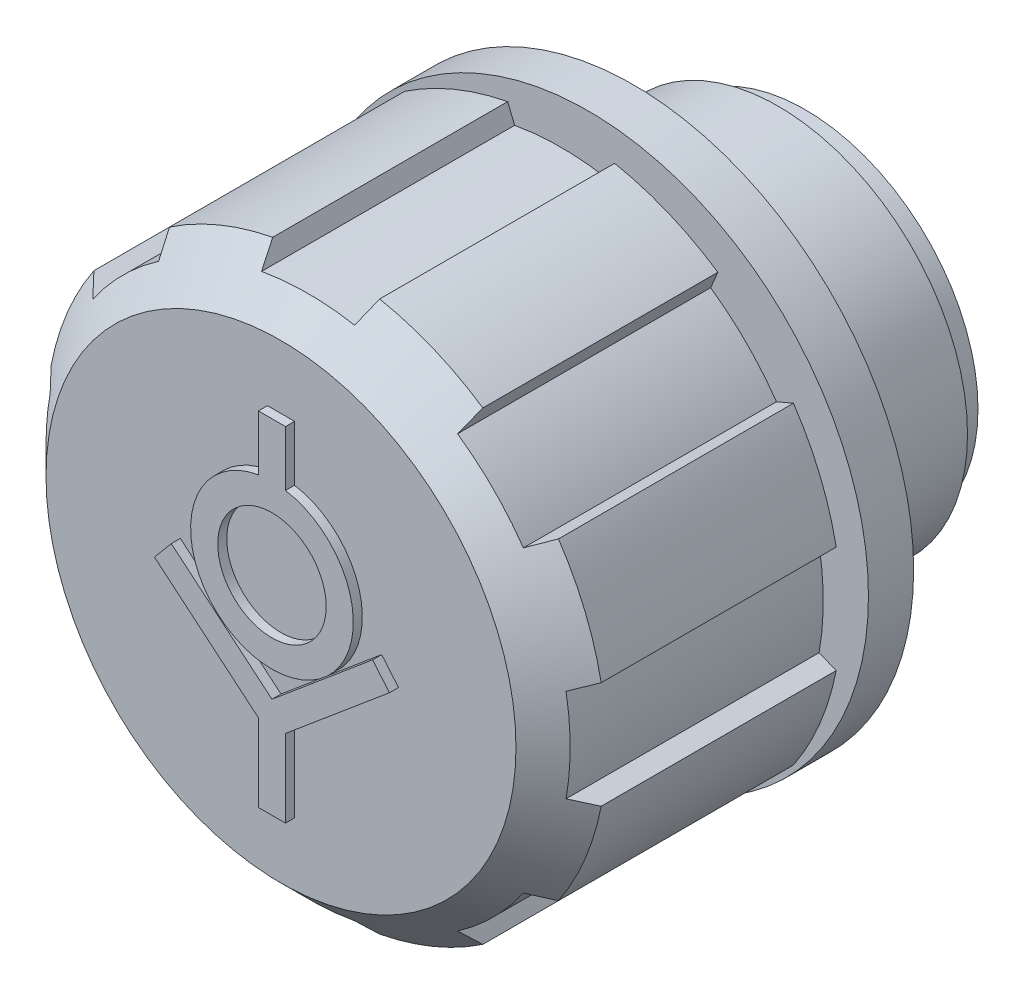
ISO-10303-21;
HEADER;
FILE_DESCRIPTION(('STEP AP214'),'2;1');
FILE_NAME('part.step','',(''),(''),'','','');
FILE_SCHEMA(('AUTOMOTIVE_DESIGN { 1 0 10303 214 1 1 1 1 }'));
ENDSEC;
DATA;
#1=APPLICATION_CONTEXT('core data for automotive mechanical design processes');
#2=APPLICATION_PROTOCOL_DEFINITION('international standard','automotive_design',2000,#1);
#3=PRODUCT_CONTEXT('',#1,'mechanical');
#4=PRODUCT('Part','Part','',(#3));
#5=PRODUCT_RELATED_PRODUCT_CATEGORY('part','',(#4));
#6=PRODUCT_DEFINITION_FORMATION('','',#4);
#7=PRODUCT_DEFINITION_CONTEXT('part definition',#1,'design');
#8=PRODUCT_DEFINITION('design','',#6,#7);
#9=PRODUCT_DEFINITION_SHAPE('','',#8);
#10=(LENGTH_UNIT() NAMED_UNIT(*) SI_UNIT(.MILLI.,.METRE.));
#11=(NAMED_UNIT(*) PLANE_ANGLE_UNIT() SI_UNIT($,.RADIAN.));
#12=(NAMED_UNIT(*) SI_UNIT($,.STERADIAN.) SOLID_ANGLE_UNIT());
#13=UNCERTAINTY_MEASURE_WITH_UNIT(LENGTH_MEASURE(1.E-05),#10,'distance_accuracy_value','');
#14=(GEOMETRIC_REPRESENTATION_CONTEXT(3) GLOBAL_UNCERTAINTY_ASSIGNED_CONTEXT((#13)) GLOBAL_UNIT_ASSIGNED_CONTEXT((#10,
#11,#12)) REPRESENTATION_CONTEXT('',''));
#15=CARTESIAN_POINT('',(0.,0.,0.));
#16=DIRECTION('',(0.,0.,1.));
#17=DIRECTION('',(1.,0.,0.));
#18=AXIS2_PLACEMENT_3D('',#15,#16,#17);
#19=CARTESIAN_POINT('',(0.,14.7954545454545,1.5));
#20=DIRECTION('',(0.,0.,-1.));
#21=DIRECTION('',(-1.,0.,0.));
#22=AXIS2_PLACEMENT_3D('',#19,#20,#21);
#23=PLANE('',#22);
#24=CARTESIAN_POINT('',(0.,0.,1.5));
#25=DIRECTION('',(0.,0.,1.));
#26=DIRECTION('',(1.,0.,0.));
#27=AXIS2_PLACEMENT_3D('',#24,#25,#26);
#28=CIRCLE('',#27,15.5);
#29=CARTESIAN_POINT('',(15.5,0.,1.49999999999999));
#30=VERTEX_POINT('',#29);
#31=EDGE_CURVE('E1046',#30,#30,#28,.T.);
#32=ORIENTED_EDGE('',*,*,#31,.F.);
#33=EDGE_LOOP('',(#32));
#34=FACE_BOUND('',#33,.T.);
#35=CARTESIAN_POINT('',(0.,0.,1.5));
#36=DIRECTION('',(0.,0.,-1.));
#37=DIRECTION('',(-1.,0.,0.));
#38=AXIS2_PLACEMENT_3D('',#35,#36,#37);
#39=CIRCLE('',#38,13.);
#40=CARTESIAN_POINT('',(-13.,0.,1.50000000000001));
#41=VERTEX_POINT('',#40);
#42=EDGE_CURVE('E1054',#41,#41,#39,.F.);
#43=ORIENTED_EDGE('',*,*,#42,.T.);
#44=EDGE_LOOP('',(#43));
#45=FACE_BOUND('',#44,.T.);
#46=ADVANCED_FACE('F14',(#34,#45),#23,.T.);
#47=CARTESIAN_POINT('',(0.,0.,2.75));
#48=DIRECTION('',(0.,0.,1.));
#49=DIRECTION('',(1.,0.,0.));
#50=AXIS2_PLACEMENT_3D('',#47,#48,#49);
#51=CYLINDRICAL_SURFACE('',#50,15.5);
#52=ORIENTED_EDGE('',*,*,#31,.T.);
#53=EDGE_LOOP('',(#52));
#54=FACE_BOUND('',#53,.T.);
#55=CARTESIAN_POINT('',(0.,0.,4.));
#56=DIRECTION('',(0.,0.,1.));
#57=DIRECTION('',(1.,0.,0.));
#58=AXIS2_PLACEMENT_3D('',#55,#56,#57);
#59=CIRCLE('',#58,15.5);
#60=CARTESIAN_POINT('',(15.5,0.,3.99999999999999));
#61=VERTEX_POINT('',#60);
#62=EDGE_CURVE('E1049',#61,#61,#59,.T.);
#63=ORIENTED_EDGE('',*,*,#62,.F.);
#64=EDGE_LOOP('',(#63));
#65=FACE_BOUND('',#64,.T.);
#66=ADVANCED_FACE('F1080',(#54,#65),#51,.T.);
#67=CARTESIAN_POINT('',(0.,12.9166666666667,4.));
#68=DIRECTION('',(0.,0.,1.));
#69=DIRECTION('',(1.,0.,0.));
#70=AXIS2_PLACEMENT_3D('',#67,#68,#69);
#71=PLANE('',#70);
#72=CARTESIAN_POINT('',(0.,0.,4.));
#73=DIRECTION('',(0.,0.,1.));
#74=DIRECTION('',(1.,0.,0.));
#75=AXIS2_PLACEMENT_3D('',#72,#73,#74);
#76=CIRCLE('',#75,10.3333333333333);
#77=CARTESIAN_POINT('',(10.3333333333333,0.,4.));
#78=VERTEX_POINT('',#77);
#79=EDGE_CURVE('E24',#78,#78,#76,.T.);
#80=ORIENTED_EDGE('',*,*,#79,.F.);
#81=EDGE_LOOP('',(#80));
#82=FACE_BOUND('',#81,.T.);
#83=ORIENTED_EDGE('',*,*,#62,.T.);
#84=EDGE_LOOP('',(#83));
#85=FACE_BOUND('',#84,.T.);
#86=ADVANCED_FACE('F1086',(#82,#85),#71,.T.);
#87=CARTESIAN_POINT('',(0.,0.,4.75));
#88=DIRECTION('',(0.,0.,1.));
#89=DIRECTION('',(1.,0.,0.));
#90=AXIS2_PLACEMENT_3D('',#87,#88,#89);
#91=CYLINDRICAL_SURFACE('',#90,10.3333333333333);
#92=ORIENTED_EDGE('',*,*,#79,.T.);
#93=EDGE_LOOP('',(#92));
#94=FACE_BOUND('',#93,.T.);
#95=CARTESIAN_POINT('',(0.,0.,5.5));
#96=DIRECTION('',(0.,0.,1.));
#97=DIRECTION('',(1.,0.,0.));
#98=AXIS2_PLACEMENT_3D('',#95,#96,#97);
#99=CIRCLE('',#98,10.3333333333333);
#100=CARTESIAN_POINT('',(10.3333333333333,0.,5.5));
#101=VERTEX_POINT('',#100);
#102=EDGE_CURVE('E9',#101,#101,#99,.T.);
#103=ORIENTED_EDGE('',*,*,#102,.F.);
#104=EDGE_LOOP('',(#103));
#105=FACE_BOUND('',#104,.T.);
#106=ADVANCED_FACE('F1362',(#94,#105),#91,.T.);
#107=CARTESIAN_POINT('',(0.,11.3666666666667,5.5));
#108=DIRECTION('',(0.,0.,-1.));
#109=DIRECTION('',(-1.,0.,0.));
#110=AXIS2_PLACEMENT_3D('',#107,#108,#109);
#111=PLANE('',#110);
#112=ORIENTED_EDGE('',*,*,#102,.T.);
#113=EDGE_LOOP('',(#112));
#114=FACE_BOUND('',#113,.T.);
#115=DIRECTION('',(-0.927183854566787,0.374606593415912,0.));
#116=VECTOR('',#115,1.);
#117=CARTESIAN_POINT('',(-14.2694497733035,2.5754229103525,5.5));
#118=LINE('',#117,#116);
#119=CARTESIAN_POINT('',(-14.2694497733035,2.57542291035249,5.5));
#120=VERTEX_POINT('',#119);
#121=CARTESIAN_POINT('',(-15.2152213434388,2.95753942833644,5.5));
#122=VERTEX_POINT('',#121);
#123=EDGE_CURVE('E33',#120,#122,#118,.T.);
#124=ORIENTED_EDGE('',*,*,#123,.T.);
#125=CARTESIAN_POINT('',(0.,0.,5.5));
#126=DIRECTION('',(0.,0.,1.));
#127=DIRECTION('',(1.,0.,0.));
#128=AXIS2_PLACEMENT_3D('',#125,#126,#127);
#129=CIRCLE('',#128,15.5);
#130=CARTESIAN_POINT('',(-12.8500823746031,8.66749000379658,5.5));
#131=VERTEX_POINT('',#130);
#132=EDGE_CURVE('E383',#122,#131,#129,.F.);
#133=ORIENTED_EDGE('',*,*,#132,.T.);
#134=DIRECTION('',(0.92050485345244,-0.390731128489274,0.));
#135=VECTOR('',#134,1.);
#136=CARTESIAN_POINT('',(-12.8500823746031,8.66749000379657,5.5));
#137=LINE('',#136,#135);
#138=CARTESIAN_POINT('',(-11.9111237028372,8.26892569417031,5.5));
#139=VERTEX_POINT('',#138);
#140=EDGE_CURVE('E845',#131,#139,#137,.T.);
#141=ORIENTED_EDGE('',*,*,#140,.T.);
#142=CARTESIAN_POINT('',(0.,0.,5.5));
#143=DIRECTION('',(0.,0.,1.));
#144=DIRECTION('',(1.,0.,0.));
#145=AXIS2_PLACEMENT_3D('',#142,#143,#144);
#146=CIRCLE('',#145,14.5);
#147=CARTESIAN_POINT('',(-8.26892569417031,11.9111237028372,5.5));
#148=VERTEX_POINT('',#147);
#149=EDGE_CURVE('E427',#139,#148,#146,.F.);
#150=ORIENTED_EDGE('',*,*,#149,.T.);
#151=DIRECTION('',(-0.390731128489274,0.92050485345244,0.));
#152=VECTOR('',#151,1.);
#153=CARTESIAN_POINT('',(-8.26892569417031,11.9111237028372,5.5));
#154=LINE('',#153,#152);
#155=CARTESIAN_POINT('',(-8.66749000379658,12.8500823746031,5.5));
#156=VERTEX_POINT('',#155);
#157=EDGE_CURVE('E312',#148,#156,#154,.T.);
#158=ORIENTED_EDGE('',*,*,#157,.T.);
#159=CARTESIAN_POINT('',(0.,0.,5.5));
#160=DIRECTION('',(0.,0.,1.));
#161=DIRECTION('',(1.,0.,0.));
#162=AXIS2_PLACEMENT_3D('',#159,#160,#161);
#163=CIRCLE('',#162,15.5);
#164=CARTESIAN_POINT('',(-2.95753942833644,15.2152213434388,5.5));
#165=VERTEX_POINT('',#164);
#166=EDGE_CURVE('E424',#156,#165,#163,.F.);
#167=ORIENTED_EDGE('',*,*,#166,.T.);
#168=DIRECTION('',(0.374606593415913,-0.927183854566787,0.));
#169=VECTOR('',#168,1.);
#170=CARTESIAN_POINT('',(-2.95753942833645,15.2152213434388,5.5));
#171=LINE('',#170,#169);
#172=CARTESIAN_POINT('',(-2.5754229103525,14.2694497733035,5.5));
#173=VERTEX_POINT('',#172);
#174=EDGE_CURVE('E314',#165,#173,#171,.T.);
#175=ORIENTED_EDGE('',*,*,#174,.T.);
#176=CARTESIAN_POINT('',(0.,0.,5.5));
#177=DIRECTION('',(0.,0.,1.));
#178=DIRECTION('',(1.,0.,0.));
#179=AXIS2_PLACEMENT_3D('',#176,#177,#178);
#180=CIRCLE('',#179,14.5);
#181=CARTESIAN_POINT('',(2.5754229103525,14.2694497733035,5.5));
#182=VERTEX_POINT('',#181);
#183=EDGE_CURVE('E421',#173,#182,#180,.F.);
#184=ORIENTED_EDGE('',*,*,#183,.T.);
#185=DIRECTION('',(0.374606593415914,0.927183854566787,0.));
#186=VECTOR('',#185,1.);
#187=CARTESIAN_POINT('',(2.5754229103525,14.2694497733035,5.5));
#188=LINE('',#187,#186);
#189=CARTESIAN_POINT('',(2.95753942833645,15.2152213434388,5.5));
#190=VERTEX_POINT('',#189);
#191=EDGE_CURVE('E727',#182,#190,#188,.T.);
#192=ORIENTED_EDGE('',*,*,#191,.T.);
#193=CARTESIAN_POINT('',(0.,0.,5.5));
#194=DIRECTION('',(0.,0.,1.));
#195=DIRECTION('',(1.,0.,0.));
#196=AXIS2_PLACEMENT_3D('',#193,#194,#195);
#197=CIRCLE('',#196,15.5);
#198=CARTESIAN_POINT('',(8.6674900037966,12.8500823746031,5.5));
#199=VERTEX_POINT('',#198);
#200=EDGE_CURVE('E418',#190,#199,#197,.F.);
#201=ORIENTED_EDGE('',*,*,#200,.T.);
#202=DIRECTION('',(-0.390731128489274,-0.92050485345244,0.));
#203=VECTOR('',#202,1.);
#204=CARTESIAN_POINT('',(8.66749000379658,12.8500823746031,5.5));
#205=LINE('',#204,#203);
#206=CARTESIAN_POINT('',(8.26892569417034,11.9111237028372,5.5));
#207=VERTEX_POINT('',#206);
#208=EDGE_CURVE('E737',#199,#207,#205,.T.);
#209=ORIENTED_EDGE('',*,*,#208,.T.);
#210=CARTESIAN_POINT('',(0.,0.,5.5));
#211=DIRECTION('',(0.,0.,1.));
#212=DIRECTION('',(1.,0.,0.));
#213=AXIS2_PLACEMENT_3D('',#210,#211,#212);
#214=CIRCLE('',#213,14.5);
#215=CARTESIAN_POINT('',(11.9111237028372,8.26892569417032,5.5));
#216=VERTEX_POINT('',#215);
#217=EDGE_CURVE('E415',#207,#216,#214,.F.);
#218=ORIENTED_EDGE('',*,*,#217,.T.);
#219=DIRECTION('',(0.92050485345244,0.390731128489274,0.));
#220=VECTOR('',#219,1.);
#221=CARTESIAN_POINT('',(11.9111237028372,8.2689256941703,5.5));
#222=LINE('',#221,#220);
#223=CARTESIAN_POINT('',(12.8500823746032,8.66749000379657,5.5));
#224=VERTEX_POINT('',#223);
#225=EDGE_CURVE('E740',#216,#224,#222,.T.);
#226=ORIENTED_EDGE('',*,*,#225,.T.);
#227=CARTESIAN_POINT('',(0.,0.,5.5));
#228=DIRECTION('',(0.,0.,1.));
#229=DIRECTION('',(1.,0.,0.));
#230=AXIS2_PLACEMENT_3D('',#227,#228,#229);
#231=CIRCLE('',#230,15.5);
#232=CARTESIAN_POINT('',(15.2152213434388,2.95753942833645,5.5));
#233=VERTEX_POINT('',#232);
#234=EDGE_CURVE('E412',#224,#233,#231,.F.);
#235=ORIENTED_EDGE('',*,*,#234,.T.);
#236=DIRECTION('',(-0.927183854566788,-0.374606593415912,0.));
#237=VECTOR('',#236,1.);
#238=CARTESIAN_POINT('',(15.2152213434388,2.95753942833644,5.5));
#239=LINE('',#238,#237);
#240=CARTESIAN_POINT('',(14.2694497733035,2.57542291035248,5.5));
#241=VERTEX_POINT('',#240);
#242=EDGE_CURVE('E892',#233,#241,#239,.T.);
#243=ORIENTED_EDGE('',*,*,#242,.T.);
#244=CARTESIAN_POINT('',(0.,0.,5.5));
#245=DIRECTION('',(0.,0.,1.));
#246=DIRECTION('',(1.,0.,0.));
#247=AXIS2_PLACEMENT_3D('',#244,#245,#246);
#248=CIRCLE('',#247,14.5);
#249=CARTESIAN_POINT('',(14.2694497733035,-2.5754229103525,5.5));
#250=VERTEX_POINT('',#249);
#251=EDGE_CURVE('E409',#241,#250,#248,.F.);
#252=ORIENTED_EDGE('',*,*,#251,.T.);
#253=DIRECTION('',(0.927183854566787,-0.374606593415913,0.));
#254=VECTOR('',#253,1.);
#255=CARTESIAN_POINT('',(14.2694497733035,-2.57542291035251,5.5));
#256=LINE('',#255,#254);
#257=CARTESIAN_POINT('',(15.2152213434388,-2.95753942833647,5.5));
#258=VERTEX_POINT('',#257);
#259=EDGE_CURVE('E885',#250,#258,#256,.T.);
#260=ORIENTED_EDGE('',*,*,#259,.T.);
#261=CARTESIAN_POINT('',(0.,0.,5.5));
#262=DIRECTION('',(0.,0.,1.));
#263=DIRECTION('',(1.,0.,0.));
#264=AXIS2_PLACEMENT_3D('',#261,#262,#263);
#265=CIRCLE('',#264,15.5);
#266=CARTESIAN_POINT('',(12.8500823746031,-8.66749000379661,5.5));
#267=VERTEX_POINT('',#266);
#268=EDGE_CURVE('E406',#258,#267,#265,.F.);
#269=ORIENTED_EDGE('',*,*,#268,.T.);
#270=DIRECTION('',(-0.92050485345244,0.390731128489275,0.));
#271=VECTOR('',#270,1.);
#272=CARTESIAN_POINT('',(12.8500823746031,-8.66749000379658,5.5));
#273=LINE('',#272,#271);
#274=CARTESIAN_POINT('',(11.9111237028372,-8.26892569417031,5.5));
#275=VERTEX_POINT('',#274);
#276=EDGE_CURVE('E878',#267,#275,#273,.T.);
#277=ORIENTED_EDGE('',*,*,#276,.T.);
#278=CARTESIAN_POINT('',(0.,-1.06889924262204E-13,5.5));
#279=DIRECTION('',(0.,0.,1.));
#280=DIRECTION('',(1.,0.,0.));
#281=AXIS2_PLACEMENT_3D('',#278,#279,#280);
#282=CIRCLE('',#281,14.5);
#283=CARTESIAN_POINT('',(8.26892569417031,-11.9111237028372,5.5));
#284=VERTEX_POINT('',#283);
#285=EDGE_CURVE('E403',#275,#284,#282,.F.);
#286=ORIENTED_EDGE('',*,*,#285,.T.);
#287=DIRECTION('',(0.390731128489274,-0.92050485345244,0.));
#288=VECTOR('',#287,1.);
#289=CARTESIAN_POINT('',(8.2689256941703,-11.9111237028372,5.5));
#290=LINE('',#289,#288);
#291=CARTESIAN_POINT('',(8.66749000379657,-12.8500823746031,5.5));
#292=VERTEX_POINT('',#291);
#293=EDGE_CURVE('E872',#284,#292,#290,.T.);
#294=ORIENTED_EDGE('',*,*,#293,.T.);
#295=CARTESIAN_POINT('',(0.,0.,5.5));
#296=DIRECTION('',(0.,0.,1.));
#297=DIRECTION('',(1.,0.,0.));
#298=AXIS2_PLACEMENT_3D('',#295,#296,#297);
#299=CIRCLE('',#298,15.5);
#300=CARTESIAN_POINT('',(2.95753942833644,-15.2152213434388,5.5));
#301=VERTEX_POINT('',#300);
#302=EDGE_CURVE('E400',#292,#301,#299,.F.);
#303=ORIENTED_EDGE('',*,*,#302,.T.);
#304=DIRECTION('',(-0.374606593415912,0.927183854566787,0.));
#305=VECTOR('',#304,1.);
#306=CARTESIAN_POINT('',(2.95753942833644,-15.2152213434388,5.5));
#307=LINE('',#306,#305);
#308=CARTESIAN_POINT('',(2.57542291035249,-14.2694497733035,5.5));
#309=VERTEX_POINT('',#308);
#310=EDGE_CURVE('E627',#301,#309,#307,.T.);
#311=ORIENTED_EDGE('',*,*,#310,.T.);
#312=CARTESIAN_POINT('',(0.,0.,5.5));
#313=DIRECTION('',(0.,0.,1.));
#314=DIRECTION('',(1.,0.,0.));
#315=AXIS2_PLACEMENT_3D('',#312,#313,#314);
#316=CIRCLE('',#315,14.5);
#317=CARTESIAN_POINT('',(-2.57542291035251,-14.2694497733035,5.5));
#318=VERTEX_POINT('',#317);
#319=EDGE_CURVE('E397',#309,#318,#316,.F.);
#320=ORIENTED_EDGE('',*,*,#319,.T.);
#321=DIRECTION('',(-0.374606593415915,-0.927183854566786,0.));
#322=VECTOR('',#321,1.);
#323=CARTESIAN_POINT('',(-2.5754229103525,-14.2694497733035,5.5));
#324=LINE('',#323,#322);
#325=CARTESIAN_POINT('',(-2.95753942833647,-15.2152213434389,5.5));
#326=VERTEX_POINT('',#325);
#327=EDGE_CURVE('E859',#318,#326,#324,.T.);
#328=ORIENTED_EDGE('',*,*,#327,.T.);
#329=CARTESIAN_POINT('',(0.,-1.22877135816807E-13,5.5));
#330=DIRECTION('',(0.,0.,1.));
#331=DIRECTION('',(1.,0.,0.));
#332=AXIS2_PLACEMENT_3D('',#329,#330,#331);
#333=CIRCLE('',#332,15.5);
#334=CARTESIAN_POINT('',(-8.66749000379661,-12.8500823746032,5.5));
#335=VERTEX_POINT('',#334);
#336=EDGE_CURVE('E394',#326,#335,#333,.F.);
#337=ORIENTED_EDGE('',*,*,#336,.T.);
#338=DIRECTION('',(0.390731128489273,0.920504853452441,0.));
#339=VECTOR('',#338,1.);
#340=CARTESIAN_POINT('',(-8.66749000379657,-12.8500823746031,5.5));
#341=LINE('',#340,#339);
#342=CARTESIAN_POINT('',(-8.2689256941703,-11.9111237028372,5.5));
#343=VERTEX_POINT('',#342);
#344=EDGE_CURVE('E853',#335,#343,#341,.T.);
#345=ORIENTED_EDGE('',*,*,#344,.T.);
#346=CARTESIAN_POINT('',(0.,-1.29982563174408E-13,5.5));
#347=DIRECTION('',(0.,0.,1.));
#348=DIRECTION('',(1.,0.,0.));
#349=AXIS2_PLACEMENT_3D('',#346,#347,#348);
#350=CIRCLE('',#349,14.4999999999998);
#351=CARTESIAN_POINT('',(-11.9111237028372,-8.26892569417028,5.5));
#352=VERTEX_POINT('',#351);
#353=EDGE_CURVE('E391',#343,#352,#350,.F.);
#354=ORIENTED_EDGE('',*,*,#353,.T.);
#355=DIRECTION('',(-0.920504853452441,-0.390731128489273,0.));
#356=VECTOR('',#355,1.);
#357=CARTESIAN_POINT('',(-11.9111237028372,-8.2689256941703,5.5));
#358=LINE('',#357,#356);
#359=CARTESIAN_POINT('',(-12.8500823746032,-8.66749000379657,5.5));
#360=VERTEX_POINT('',#359);
#361=EDGE_CURVE('E514',#352,#360,#358,.T.);
#362=ORIENTED_EDGE('',*,*,#361,.T.);
#363=CARTESIAN_POINT('',(0.,0.,5.5));
#364=DIRECTION('',(0.,0.,1.));
#365=DIRECTION('',(1.,0.,0.));
#366=AXIS2_PLACEMENT_3D('',#363,#364,#365);
#367=CIRCLE('',#366,15.5);
#368=CARTESIAN_POINT('',(-15.2152213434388,-2.95753942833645,5.5));
#369=VERTEX_POINT('',#368);
#370=EDGE_CURVE('E388',#360,#369,#367,.F.);
#371=ORIENTED_EDGE('',*,*,#370,.T.);
#372=DIRECTION('',(0.927183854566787,0.374606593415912,0.));
#373=VECTOR('',#372,1.);
#374=CARTESIAN_POINT('',(-15.2152213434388,-2.95753942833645,5.5));
#375=LINE('',#374,#373);
#376=CARTESIAN_POINT('',(-14.2694497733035,-2.57542291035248,5.5));
#377=VERTEX_POINT('',#376);
#378=EDGE_CURVE('E510',#369,#377,#375,.T.);
#379=ORIENTED_EDGE('',*,*,#378,.T.);
#380=CARTESIAN_POINT('',(0.,0.,5.5));
#381=DIRECTION('',(0.,0.,1.));
#382=DIRECTION('',(1.,0.,0.));
#383=AXIS2_PLACEMENT_3D('',#380,#381,#382);
#384=CIRCLE('',#383,14.5);
#385=EDGE_CURVE('E386',#377,#120,#384,.F.);
#386=ORIENTED_EDGE('',*,*,#385,.T.);
#387=EDGE_LOOP('',(#124,#133,#141,#150,#158,#167,#175,#184,#192,#201,#209,#218,#226,#235,#243,
#252,#260,#269,#277,#286,#294,#303,#311,#320,#328,#337,#345,#354,#362,#371,#379,#386));
#388=FACE_BOUND('',#387,.T.);
#389=ADVANCED_FACE('F607',(#114,#388),#111,.T.);
#390=CARTESIAN_POINT('',(0.,0.,21.));
#391=DIRECTION('',(0.,0.,1.));
#392=DIRECTION('',(1.,0.,0.));
#393=AXIS2_PLACEMENT_3D('',#390,#391,#392);
#394=PLANE('',#393);
#395=CARTESIAN_POINT('',(0.,2.,21.));
#396=DIRECTION('',(0.,0.,1.));
#397=DIRECTION('',(1.,0.,0.));
#398=AXIS2_PLACEMENT_3D('',#395,#396,#397);
#399=CIRCLE('',#398,3.);
#400=CARTESIAN_POINT('',(3.00000000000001,2.,21.));
#401=VERTEX_POINT('',#400);
#402=EDGE_CURVE('E18',#401,#401,#399,.T.);
#403=ORIENTED_EDGE('',*,*,#402,.T.);
#404=EDGE_LOOP('',(#403));
#405=FACE_BOUND('',#404,.T.);
#406=ADVANCED_FACE('F16',(#405),#394,.T.);
#407=CARTESIAN_POINT('',(0.,2.,22.));
#408=DIRECTION('',(0.,0.,1.));
#409=DIRECTION('',(1.,0.,0.));
#410=AXIS2_PLACEMENT_3D('',#407,#408,#409);
#411=CYLINDRICAL_SURFACE('',#410,3.);
#412=ORIENTED_EDGE('',*,*,#402,.F.);
#413=EDGE_LOOP('',(#412));
#414=FACE_BOUND('',#413,.T.);
#415=CARTESIAN_POINT('',(0.,2.,21.5));
#416=DIRECTION('',(0.,0.,1.));
#417=DIRECTION('',(1.,0.,0.));
#418=AXIS2_PLACEMENT_3D('',#415,#416,#417);
#419=CIRCLE('',#418,3.);
#420=CARTESIAN_POINT('',(3.00000000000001,2.,21.5));
#421=VERTEX_POINT('',#420);
#422=EDGE_CURVE('E379',#421,#421,#419,.F.);
#423=ORIENTED_EDGE('',*,*,#422,.F.);
#424=EDGE_LOOP('',(#423));
#425=FACE_BOUND('',#424,.T.);
#426=ADVANCED_FACE('F599',(#414,#425),#411,.F.);
#427=CARTESIAN_POINT('',(0.,0.,21.5));
#428=DIRECTION('',(0.,0.,1.));
#429=DIRECTION('',(1.,0.,0.));
#430=AXIS2_PLACEMENT_3D('',#427,#428,#429);
#431=PLANE('',#430);
#432=DIRECTION('',(-0.766044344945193,0.642787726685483,0.));
#433=VECTOR('',#432,1.);
#434=CARTESIAN_POINT('',(-1.7162723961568E-08,-3.93960035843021,21.5));
#435=LINE('',#434,#433);
#436=CARTESIAN_POINT('',(-5.5679569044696,0.732471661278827,21.5));
#437=VERTEX_POINT('',#436);
#438=CARTESIAN_POINT('',(-1.71627241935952E-08,-3.93960035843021,21.5));
#439=VERTEX_POINT('',#438);
#440=EDGE_CURVE('E353',#437,#439,#435,.F.);
#441=ORIENTED_EDGE('',*,*,#440,.F.);
#442=DIRECTION('',(-0.642786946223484,-0.766044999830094,0.));
#443=VECTOR('',#442,1.);
#444=CARTESIAN_POINT('',(-5.5679569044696,0.732471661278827,21.5));
#445=LINE('',#444,#443);
#446=CARTESIAN_POINT('',(-6.5,-0.378295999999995,21.5));
#447=VERTEX_POINT('',#446);
#448=EDGE_CURVE('E358',#447,#437,#445,.F.);
#449=ORIENTED_EDGE('',*,*,#448,.F.);
#450=DIRECTION('',(0.766044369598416,-0.642787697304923,0.));
#451=VECTOR('',#450,1.);
#452=CARTESIAN_POINT('',(-6.5,-0.378295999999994,21.5));
#453=LINE('',#452,#451);
#454=CARTESIAN_POINT('',(-0.749999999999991,-5.20312,21.5));
#455=VERTEX_POINT('',#454);
#456=EDGE_CURVE('E363',#455,#447,#453,.F.);
#457=ORIENTED_EDGE('',*,*,#456,.F.);
#458=DIRECTION('',(0.,1.,0.));
#459=VECTOR('',#458,1.);
#460=CARTESIAN_POINT('',(-0.749999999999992,-5.20312,21.5));
#461=LINE('',#460,#459);
#462=CARTESIAN_POINT('',(-0.749999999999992,-9.5,21.5));
#463=VERTEX_POINT('',#462);
#464=EDGE_CURVE('E368',#463,#455,#461,.T.);
#465=ORIENTED_EDGE('',*,*,#464,.F.);
#466=DIRECTION('',(1.,0.,0.));
#467=VECTOR('',#466,1.);
#468=CARTESIAN_POINT('',(0.,-9.5,21.5));
#469=LINE('',#468,#467);
#470=CARTESIAN_POINT('',(0.750000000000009,-9.5,21.5));
#471=VERTEX_POINT('',#470);
#472=EDGE_CURVE('E255',#463,#471,#469,.T.);
#473=ORIENTED_EDGE('',*,*,#472,.T.);
#474=DIRECTION('',(0.,1.,0.));
#475=VECTOR('',#474,1.);
#476=CARTESIAN_POINT('',(0.750000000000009,-9.5,21.5));
#477=LINE('',#476,#475);
#478=CARTESIAN_POINT('',(0.750000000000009,-5.20312,21.5));
#479=VERTEX_POINT('',#478);
#480=EDGE_CURVE('E332',#479,#471,#477,.F.);
#481=ORIENTED_EDGE('',*,*,#480,.F.);
#482=DIRECTION('',(0.766044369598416,0.642787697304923,0.));
#483=VECTOR('',#482,1.);
#484=CARTESIAN_POINT('',(0.750000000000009,-5.20312,21.5));
#485=LINE('',#484,#483);
#486=CARTESIAN_POINT('',(6.5,-0.378295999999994,21.5));
#487=VERTEX_POINT('',#486);
#488=EDGE_CURVE('E338',#487,#479,#485,.F.);
#489=ORIENTED_EDGE('',*,*,#488,.F.);
#490=DIRECTION('',(-0.642786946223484,0.766044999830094,0.));
#491=VECTOR('',#490,1.);
#492=CARTESIAN_POINT('',(6.5,-0.378295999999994,21.5));
#493=LINE('',#492,#491);
#494=CARTESIAN_POINT('',(5.56795934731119,0.732468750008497,21.5));
#495=VERTEX_POINT('',#494);
#496=EDGE_CURVE('E343',#495,#487,#493,.F.);
#497=ORIENTED_EDGE('',*,*,#496,.F.);
#498=DIRECTION('',(-0.766044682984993,-0.642787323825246,0.));
#499=VECTOR('',#498,1.);
#500=CARTESIAN_POINT('',(5.56795934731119,0.732468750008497,21.5));
#501=LINE('',#500,#499);
#502=EDGE_CURVE('E348',#439,#495,#501,.F.);
#503=ORIENTED_EDGE('',*,*,#502,.F.);
#504=EDGE_LOOP('',(#441,#449,#457,#465,#473,#481,#489,#497,#503));
#505=FACE_BOUND('',#504,.T.);
#506=ADVANCED_FACE('F597',(#505),#431,.T.);
#507=CARTESIAN_POINT('',(0.,0.,21.5));
#508=DIRECTION('',(0.,0.,1.));
#509=DIRECTION('',(1.,0.,0.));
#510=AXIS2_PLACEMENT_3D('',#507,#508,#509);
#511=PLANE('',#510);
#512=DIRECTION('',(1.,0.,0.));
#513=VECTOR('',#512,1.);
#514=CARTESIAN_POINT('',(0.,9.5,21.5));
#515=LINE('',#514,#513);
#516=CARTESIAN_POINT('',(0.750000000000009,9.5,21.5));
#517=VERTEX_POINT('',#516);
#518=CARTESIAN_POINT('',(-0.749999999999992,9.5,21.5));
#519=VERTEX_POINT('',#518);
#520=EDGE_CURVE('E370',#517,#519,#515,.F.);
#521=ORIENTED_EDGE('',*,*,#520,.T.);
#522=DIRECTION('',(0.,1.,0.));
#523=VECTOR('',#522,1.);
#524=CARTESIAN_POINT('',(-0.749999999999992,9.5,21.5));
#525=LINE('',#524,#523);
#526=CARTESIAN_POINT('',(-0.749999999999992,6.43705983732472,21.5));
#527=VERTEX_POINT('',#526);
#528=EDGE_CURVE('E305',#527,#519,#525,.T.);
#529=ORIENTED_EDGE('',*,*,#528,.F.);
#530=CARTESIAN_POINT('',(0.,2.,21.5));
#531=DIRECTION('',(0.,0.,1.));
#532=DIRECTION('',(1.,0.,0.));
#533=AXIS2_PLACEMENT_3D('',#530,#531,#532);
#534=CIRCLE('',#533,4.5);
#535=CARTESIAN_POINT('',(0.75000000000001,6.43705983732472,21.5));
#536=VERTEX_POINT('',#535);
#537=EDGE_CURVE('E240',#536,#527,#534,.F.);
#538=ORIENTED_EDGE('',*,*,#537,.F.);
#539=DIRECTION('',(0.,1.,0.));
#540=VECTOR('',#539,1.);
#541=CARTESIAN_POINT('',(0.75000000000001,6.43705983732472,21.5));
#542=LINE('',#541,#540);
#543=EDGE_CURVE('E323',#517,#536,#542,.F.);
#544=ORIENTED_EDGE('',*,*,#543,.F.);
#545=EDGE_LOOP('',(#521,#529,#538,#544));
#546=FACE_BOUND('',#545,.T.);
#547=ORIENTED_EDGE('',*,*,#422,.T.);
#548=EDGE_LOOP('',(#547));
#549=FACE_BOUND('',#548,.T.);
#550=ADVANCED_FACE('F571',(#546,#549),#511,.T.);
#551=CARTESIAN_POINT('',(0.750000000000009,-5.20312,21.5));
#552=DIRECTION('',(0.642787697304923,-0.766044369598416,0.));
#553=DIRECTION('',(0.766044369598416,0.642787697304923,0.));
#554=AXIS2_PLACEMENT_3D('',#551,#552,#553);
#555=PLANE('',#554);
#556=ORIENTED_EDGE('',*,*,#488,.T.);
#557=DIRECTION('',(0.,0.,-1.));
#558=VECTOR('',#557,1.);
#559=CARTESIAN_POINT('',(0.750000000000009,-5.20312,21.5));
#560=LINE('',#559,#558);
#561=CARTESIAN_POINT('',(0.75,-5.20312,21.));
#562=VERTEX_POINT('',#561);
#563=EDGE_CURVE('E335',#562,#479,#560,.F.);
#564=ORIENTED_EDGE('',*,*,#563,.F.);
#565=DIRECTION('',(-0.766044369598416,-0.642787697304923,0.));
#566=VECTOR('',#565,1.);
#567=CARTESIAN_POINT('',(6.5,-0.378295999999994,21.));
#568=LINE('',#567,#566);
#569=CARTESIAN_POINT('',(6.5,-0.378295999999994,21.));
#570=VERTEX_POINT('',#569);
#571=EDGE_CURVE('E769',#570,#562,#568,.T.);
#572=ORIENTED_EDGE('',*,*,#571,.F.);
#573=DIRECTION('',(0.,0.,1.));
#574=VECTOR('',#573,1.);
#575=CARTESIAN_POINT('',(6.5,-0.378295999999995,21.5));
#576=LINE('',#575,#574);
#577=EDGE_CURVE('E340',#570,#487,#576,.T.);
#578=ORIENTED_EDGE('',*,*,#577,.T.);
#579=EDGE_LOOP('',(#556,#564,#572,#578));
#580=FACE_BOUND('',#579,.T.);
#581=ADVANCED_FACE('F567',(#580),#555,.T.);
#582=CARTESIAN_POINT('',(6.5,-0.378295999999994,21.5));
#583=DIRECTION('',(0.766044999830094,0.642786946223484,0.));
#584=DIRECTION('',(-0.642786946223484,0.766044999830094,0.));
#585=AXIS2_PLACEMENT_3D('',#582,#583,#584);
#586=PLANE('',#585);
#587=ORIENTED_EDGE('',*,*,#496,.T.);
#588=ORIENTED_EDGE('',*,*,#577,.F.);
#589=DIRECTION('',(0.642786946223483,-0.766044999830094,0.));
#590=VECTOR('',#589,1.);
#591=CARTESIAN_POINT('',(5.56795934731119,0.732468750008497,21.));
#592=LINE('',#591,#590);
#593=CARTESIAN_POINT('',(5.56795934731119,0.732468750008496,21.));
#594=VERTEX_POINT('',#593);
#595=EDGE_CURVE('E772',#594,#570,#592,.T.);
#596=ORIENTED_EDGE('',*,*,#595,.F.);
#597=DIRECTION('',(0.,0.,1.));
#598=VECTOR('',#597,1.);
#599=CARTESIAN_POINT('',(5.56795934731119,0.732468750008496,21.5));
#600=LINE('',#599,#598);
#601=EDGE_CURVE('E345',#594,#495,#600,.T.);
#602=ORIENTED_EDGE('',*,*,#601,.T.);
#603=EDGE_LOOP('',(#587,#588,#596,#602));
#604=FACE_BOUND('',#603,.T.);
#605=ADVANCED_FACE('F570',(#604),#586,.T.);
#606=CARTESIAN_POINT('',(5.56795934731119,0.732468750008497,21.5));
#607=DIRECTION('',(-0.642787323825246,0.766044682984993,0.));
#608=DIRECTION('',(-0.766044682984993,-0.642787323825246,0.));
#609=AXIS2_PLACEMENT_3D('',#606,#607,#608);
#610=PLANE('',#609);
#611=ORIENTED_EDGE('',*,*,#502,.T.);
#612=ORIENTED_EDGE('',*,*,#601,.F.);
#613=DIRECTION('',(0.766044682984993,0.642787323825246,0.));
#614=VECTOR('',#613,1.);
#615=CARTESIAN_POINT('',(-1.71627241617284E-08,-3.93960035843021,21.));
#616=LINE('',#615,#614);
#617=CARTESIAN_POINT('',(-1.71627240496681E-08,-3.93960035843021,21.));
#618=VERTEX_POINT('',#617);
#619=EDGE_CURVE('E775',#618,#594,#616,.T.);
#620=ORIENTED_EDGE('',*,*,#619,.F.);
#621=DIRECTION('',(0.,0.,1.));
#622=VECTOR('',#621,1.);
#623=CARTESIAN_POINT('',(-1.71627235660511E-08,-3.93960035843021,21.5));
#624=LINE('',#623,#622);
#625=EDGE_CURVE('E350',#618,#439,#624,.T.);
#626=ORIENTED_EDGE('',*,*,#625,.T.);
#627=EDGE_LOOP('',(#611,#612,#620,#626));
#628=FACE_BOUND('',#627,.T.);
#629=ADVANCED_FACE('F575',(#628),#610,.T.);
#630=CARTESIAN_POINT('',(-1.7162723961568E-08,-3.93960035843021,21.5));
#631=DIRECTION('',(0.642787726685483,0.766044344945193,0.));
#632=DIRECTION('',(-0.766044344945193,0.642787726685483,0.));
#633=AXIS2_PLACEMENT_3D('',#630,#631,#632);
#634=PLANE('',#633);
#635=ORIENTED_EDGE('',*,*,#440,.T.);
#636=ORIENTED_EDGE('',*,*,#625,.F.);
#637=DIRECTION('',(0.766044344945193,-0.642787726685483,0.));
#638=VECTOR('',#637,1.);
#639=CARTESIAN_POINT('',(-5.5679569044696,0.732471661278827,21.));
#640=LINE('',#639,#638);
#641=CARTESIAN_POINT('',(-5.5679569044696,0.732471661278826,21.));
#642=VERTEX_POINT('',#641);
#643=EDGE_CURVE('E778',#642,#618,#640,.T.);
#644=ORIENTED_EDGE('',*,*,#643,.F.);
#645=DIRECTION('',(0.,0.,1.));
#646=VECTOR('',#645,1.);
#647=CARTESIAN_POINT('',(-5.56795690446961,0.732471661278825,21.5));
#648=LINE('',#647,#646);
#649=EDGE_CURVE('E355',#642,#437,#648,.T.);
#650=ORIENTED_EDGE('',*,*,#649,.T.);
#651=EDGE_LOOP('',(#635,#636,#644,#650));
#652=FACE_BOUND('',#651,.T.);
#653=ADVANCED_FACE('F579',(#652),#634,.T.);
#654=CARTESIAN_POINT('',(-5.5679569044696,0.732471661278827,21.5));
#655=DIRECTION('',(-0.766044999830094,0.642786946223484,0.));
#656=DIRECTION('',(-0.642786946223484,-0.766044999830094,0.));
#657=AXIS2_PLACEMENT_3D('',#654,#655,#656);
#658=PLANE('',#657);
#659=ORIENTED_EDGE('',*,*,#448,.T.);
#660=ORIENTED_EDGE('',*,*,#649,.F.);
#661=DIRECTION('',(0.642786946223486,0.766044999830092,0.));
#662=VECTOR('',#661,1.);
#663=CARTESIAN_POINT('',(-6.5,-0.378295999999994,21.));
#664=LINE('',#663,#662);
#665=CARTESIAN_POINT('',(-6.5,-0.378295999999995,21.));
#666=VERTEX_POINT('',#665);
#667=EDGE_CURVE('E781',#666,#642,#664,.T.);
#668=ORIENTED_EDGE('',*,*,#667,.F.);
#669=DIRECTION('',(0.,0.,1.));
#670=VECTOR('',#669,1.);
#671=CARTESIAN_POINT('',(-6.5,-0.378296,21.5));
#672=LINE('',#671,#670);
#673=EDGE_CURVE('E360',#666,#447,#672,.T.);
#674=ORIENTED_EDGE('',*,*,#673,.T.);
#675=EDGE_LOOP('',(#659,#660,#668,#674));
#676=FACE_BOUND('',#675,.T.);
#677=ADVANCED_FACE('F583',(#676),#658,.T.);
#678=CARTESIAN_POINT('',(-6.5,-0.378295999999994,21.5));
#679=DIRECTION('',(-0.642787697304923,-0.766044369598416,0.));
#680=DIRECTION('',(0.766044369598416,-0.642787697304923,0.));
#681=AXIS2_PLACEMENT_3D('',#678,#679,#680);
#682=PLANE('',#681);
#683=ORIENTED_EDGE('',*,*,#456,.T.);
#684=ORIENTED_EDGE('',*,*,#673,.F.);
#685=DIRECTION('',(-0.766044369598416,0.642787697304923,0.));
#686=VECTOR('',#685,1.);
#687=CARTESIAN_POINT('',(-0.749999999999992,-5.20312,21.));
#688=LINE('',#687,#686);
#689=CARTESIAN_POINT('',(-0.749999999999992,-5.20312,21.));
#690=VERTEX_POINT('',#689);
#691=EDGE_CURVE('E784',#690,#666,#688,.T.);
#692=ORIENTED_EDGE('',*,*,#691,.F.);
#693=DIRECTION('',(0.,0.,1.));
#694=VECTOR('',#693,1.);
#695=CARTESIAN_POINT('',(-0.749999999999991,-5.20312,21.5));
#696=LINE('',#695,#694);
#697=EDGE_CURVE('E365',#690,#455,#696,.T.);
#698=ORIENTED_EDGE('',*,*,#697,.T.);
#699=EDGE_LOOP('',(#683,#684,#692,#698));
#700=FACE_BOUND('',#699,.T.);
#701=ADVANCED_FACE('F587',(#700),#682,.T.);
#702=CARTESIAN_POINT('',(-0.749999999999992,-5.20312,21.5));
#703=DIRECTION('',(-1.,0.,0.));
#704=DIRECTION('',(0.,0.,1.));
#705=AXIS2_PLACEMENT_3D('',#702,#703,#704);
#706=PLANE('',#705);
#707=ORIENTED_EDGE('',*,*,#464,.T.);
#708=ORIENTED_EDGE('',*,*,#697,.F.);
#709=DIRECTION('',(0.,1.,0.));
#710=VECTOR('',#709,1.);
#711=CARTESIAN_POINT('',(-0.749999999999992,6.5,21.));
#712=LINE('',#711,#710);
#713=CARTESIAN_POINT('',(-0.749999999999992,-9.5,21.));
#714=VERTEX_POINT('',#713);
#715=EDGE_CURVE('E325',#714,#690,#712,.T.);
#716=ORIENTED_EDGE('',*,*,#715,.F.);
#717=DIRECTION('',(0.,0.,1.));
#718=VECTOR('',#717,1.);
#719=CARTESIAN_POINT('',(-0.749999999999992,-9.5,21.5));
#720=LINE('',#719,#718);
#721=EDGE_CURVE('E328',#463,#714,#720,.F.);
#722=ORIENTED_EDGE('',*,*,#721,.F.);
#723=EDGE_LOOP('',(#707,#708,#716,#722));
#724=FACE_BOUND('',#723,.T.);
#725=ADVANCED_FACE('F563',(#724),#706,.T.);
#726=CARTESIAN_POINT('',(-0.749999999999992,-9.5,21.5));
#727=DIRECTION('',(0.,-1.,0.));
#728=DIRECTION('',(1.,0.,0.));
#729=AXIS2_PLACEMENT_3D('',#726,#727,#728);
#730=PLANE('',#729);
#731=ORIENTED_EDGE('',*,*,#472,.F.);
#732=ORIENTED_EDGE('',*,*,#721,.T.);
#733=DIRECTION('',(1.,0.,0.));
#734=VECTOR('',#733,1.);
#735=CARTESIAN_POINT('',(0.,-9.5,21.));
#736=LINE('',#735,#734);
#737=CARTESIAN_POINT('',(0.75,-9.5,21.));
#738=VERTEX_POINT('',#737);
#739=EDGE_CURVE('E761',#738,#714,#736,.F.);
#740=ORIENTED_EDGE('',*,*,#739,.F.);
#741=DIRECTION('',(0.,0.,1.));
#742=VECTOR('',#741,1.);
#743=CARTESIAN_POINT('',(0.750000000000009,-9.5,21.5));
#744=LINE('',#743,#742);
#745=EDGE_CURVE('E330',#738,#471,#744,.T.);
#746=ORIENTED_EDGE('',*,*,#745,.T.);
#747=EDGE_LOOP('',(#731,#732,#740,#746));
#748=FACE_BOUND('',#747,.T.);
#749=ADVANCED_FACE('F560',(#748),#730,.T.);
#750=CARTESIAN_POINT('',(0.750000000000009,-9.5,21.5));
#751=DIRECTION('',(1.,0.,0.));
#752=DIRECTION('',(0.,0.,-1.));
#753=AXIS2_PLACEMENT_3D('',#750,#751,#752);
#754=PLANE('',#753);
#755=ORIENTED_EDGE('',*,*,#480,.T.);
#756=ORIENTED_EDGE('',*,*,#745,.F.);
#757=DIRECTION('',(0.,1.,0.));
#758=VECTOR('',#757,1.);
#759=CARTESIAN_POINT('',(0.75,6.5,21.));
#760=LINE('',#759,#758);
#761=EDGE_CURVE('E766',#562,#738,#760,.F.);
#762=ORIENTED_EDGE('',*,*,#761,.F.);
#763=ORIENTED_EDGE('',*,*,#563,.T.);
#764=EDGE_LOOP('',(#755,#756,#762,#763));
#765=FACE_BOUND('',#764,.T.);
#766=ADVANCED_FACE('F556',(#765),#754,.T.);
#767=CARTESIAN_POINT('',(0.,2.,21.5));
#768=DIRECTION('',(0.,0.,1.));
#769=DIRECTION('',(1.,0.,0.));
#770=AXIS2_PLACEMENT_3D('',#767,#768,#769);
#771=CYLINDRICAL_SURFACE('',#770,4.5);
#772=DIRECTION('',(0.,0.,1.));
#773=VECTOR('',#772,1.);
#774=CARTESIAN_POINT('',(-0.749999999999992,6.43705983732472,21.5));
#775=LINE('',#774,#773);
#776=CARTESIAN_POINT('',(-0.749999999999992,6.43705983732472,21.));
#777=VERTEX_POINT('',#776);
#778=EDGE_CURVE('E375',#777,#527,#775,.T.);
#779=ORIENTED_EDGE('',*,*,#778,.F.);
#780=CARTESIAN_POINT('',(0.,2.,21.));
#781=DIRECTION('',(0.,0.,1.));
#782=DIRECTION('',(1.,0.,0.));
#783=AXIS2_PLACEMENT_3D('',#780,#781,#782);
#784=CIRCLE('',#783,4.5);
#785=CARTESIAN_POINT('',(0.750000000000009,6.43705983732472,21.));
#786=VERTEX_POINT('',#785);
#787=EDGE_CURVE('E298',#786,#777,#784,.F.);
#788=ORIENTED_EDGE('',*,*,#787,.F.);
#789=DIRECTION('',(0.,0.,1.));
#790=VECTOR('',#789,1.);
#791=CARTESIAN_POINT('',(0.750000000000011,6.43705983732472,21.5));
#792=LINE('',#791,#790);
#793=EDGE_CURVE('E321',#786,#536,#792,.T.);
#794=ORIENTED_EDGE('',*,*,#793,.T.);
#795=ORIENTED_EDGE('',*,*,#537,.T.);
#796=EDGE_LOOP('',(#779,#788,#794,#795));
#797=FACE_BOUND('',#796,.T.);
#798=ADVANCED_FACE('F553',(#797),#771,.T.);
#799=CARTESIAN_POINT('',(0.75000000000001,6.43705983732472,21.5));
#800=DIRECTION('',(1.,0.,0.));
#801=DIRECTION('',(0.,0.,-1.));
#802=AXIS2_PLACEMENT_3D('',#799,#800,#801);
#803=PLANE('',#802);
#804=ORIENTED_EDGE('',*,*,#543,.T.);
#805=ORIENTED_EDGE('',*,*,#793,.F.);
#806=DIRECTION('',(0.,1.,0.));
#807=VECTOR('',#806,1.);
#808=CARTESIAN_POINT('',(0.75,6.5,21.));
#809=LINE('',#808,#807);
#810=CARTESIAN_POINT('',(0.75,9.5,21.));
#811=VERTEX_POINT('',#810);
#812=EDGE_CURVE('E618',#811,#786,#809,.F.);
#813=ORIENTED_EDGE('',*,*,#812,.F.);
#814=DIRECTION('',(0.,0.,1.));
#815=VECTOR('',#814,1.);
#816=CARTESIAN_POINT('',(0.750000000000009,9.5,21.5));
#817=LINE('',#816,#815);
#818=EDGE_CURVE('E308',#517,#811,#817,.F.);
#819=ORIENTED_EDGE('',*,*,#818,.F.);
#820=EDGE_LOOP('',(#804,#805,#813,#819));
#821=FACE_BOUND('',#820,.T.);
#822=ADVANCED_FACE('F550',(#821),#803,.T.);
#823=CARTESIAN_POINT('',(0.750000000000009,9.5,21.5));
#824=DIRECTION('',(0.,1.,0.));
#825=DIRECTION('',(-1.,0.,0.));
#826=AXIS2_PLACEMENT_3D('',#823,#824,#825);
#827=PLANE('',#826);
#828=ORIENTED_EDGE('',*,*,#520,.F.);
#829=ORIENTED_EDGE('',*,*,#818,.T.);
#830=DIRECTION('',(1.,0.,0.));
#831=VECTOR('',#830,1.);
#832=CARTESIAN_POINT('',(0.,9.5,21.));
#833=LINE('',#832,#831);
#834=CARTESIAN_POINT('',(-0.749999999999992,9.5,21.));
#835=VERTEX_POINT('',#834);
#836=EDGE_CURVE('E296',#835,#811,#833,.T.);
#837=ORIENTED_EDGE('',*,*,#836,.F.);
#838=DIRECTION('',(0.,0.,1.));
#839=VECTOR('',#838,1.);
#840=CARTESIAN_POINT('',(-0.749999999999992,9.5,21.5));
#841=LINE('',#840,#839);
#842=EDGE_CURVE('E303',#835,#519,#841,.T.);
#843=ORIENTED_EDGE('',*,*,#842,.T.);
#844=EDGE_LOOP('',(#828,#829,#837,#843));
#845=FACE_BOUND('',#844,.T.);
#846=ADVANCED_FACE('F310',(#845),#827,.T.);
#847=CARTESIAN_POINT('',(-0.749999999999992,9.5,21.5));
#848=DIRECTION('',(-1.,0.,0.));
#849=DIRECTION('',(0.,0.,1.));
#850=AXIS2_PLACEMENT_3D('',#847,#848,#849);
#851=PLANE('',#850);
#852=ORIENTED_EDGE('',*,*,#528,.T.);
#853=ORIENTED_EDGE('',*,*,#842,.F.);
#854=DIRECTION('',(0.,1.,0.));
#855=VECTOR('',#854,1.);
#856=CARTESIAN_POINT('',(-0.749999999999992,6.5,21.));
#857=LINE('',#856,#855);
#858=EDGE_CURVE('E290',#777,#835,#857,.T.);
#859=ORIENTED_EDGE('',*,*,#858,.F.);
#860=ORIENTED_EDGE('',*,*,#778,.T.);
#861=EDGE_LOOP('',(#852,#853,#859,#860));
#862=FACE_BOUND('',#861,.T.);
#863=ADVANCED_FACE('F304',(#862),#851,.T.);
#864=CARTESIAN_POINT('',(0.,6.5,21.));
#865=DIRECTION('',(0.,0.,1.));
#866=DIRECTION('',(1.,0.,0.));
#867=AXIS2_PLACEMENT_3D('',#864,#865,#866);
#868=PLANE('',#867);
#869=CARTESIAN_POINT('',(0.,0.,21.));
#870=DIRECTION('',(0.,0.,-1.));
#871=DIRECTION('',(-1.,0.,0.));
#872=AXIS2_PLACEMENT_3D('',#869,#870,#871);
#873=CIRCLE('',#872,13.);
#874=CARTESIAN_POINT('',(-13.,0.,21.));
#875=VERTEX_POINT('',#874);
#876=EDGE_CURVE('E846',#875,#875,#873,.T.);
#877=ORIENTED_EDGE('',*,*,#876,.F.);
#878=EDGE_LOOP('',(#877));
#879=FACE_BOUND('',#878,.T.);
#880=ORIENTED_EDGE('',*,*,#858,.T.);
#881=ORIENTED_EDGE('',*,*,#836,.T.);
#882=ORIENTED_EDGE('',*,*,#812,.T.);
#883=ORIENTED_EDGE('',*,*,#787,.T.);
#884=EDGE_LOOP('',(#880,#881,#882,#883));
#885=FACE_BOUND('',#884,.T.);
#886=ORIENTED_EDGE('',*,*,#761,.T.);
#887=ORIENTED_EDGE('',*,*,#739,.T.);
#888=ORIENTED_EDGE('',*,*,#715,.T.);
#889=ORIENTED_EDGE('',*,*,#691,.T.);
#890=ORIENTED_EDGE('',*,*,#667,.T.);
#891=ORIENTED_EDGE('',*,*,#643,.T.);
#892=ORIENTED_EDGE('',*,*,#619,.T.);
#893=ORIENTED_EDGE('',*,*,#595,.T.);
#894=ORIENTED_EDGE('',*,*,#571,.T.);
#895=EDGE_LOOP('',(#886,#887,#888,#889,#890,#891,#892,#893,#894));
#896=FACE_BOUND('',#895,.T.);
#897=ADVANCED_FACE('F292',(#879,#885,#896),#868,.T.);
#898=CARTESIAN_POINT('',(0.,0.,18.5));
#899=DIRECTION('',(0.,0.,-1.));
#900=DIRECTION('',(-1.,0.,0.));
#901=AXIS2_PLACEMENT_3D('',#898,#899,#900);
#902=CONICAL_SURFACE('',#901,15.5,0.785398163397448);
#903=CARTESIAN_POINT('',(2.95753942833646,15.2152213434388,18.5));
#904=CARTESIAN_POINT('',(2.89389547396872,15.0576970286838,18.6667813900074));
#905=CARTESIAN_POINT('',(2.83023045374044,14.9001205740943,18.8335054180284));
#906=CARTESIAN_POINT('',(2.70285828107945,14.58486338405,19.1668387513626));
#907=CARTESIAN_POINT('',(2.63915112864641,14.4271826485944,19.3334480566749));
#908=CARTESIAN_POINT('',(2.57542291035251,14.2694497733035,19.5));
#909=B_SPLINE_CURVE_WITH_KNOTS('',3,(#903,#904,#905,#906,#907,#908),.UNSPECIFIED.,.F.,.F.,(4,2,
4),(0.,0.714229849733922,1.42845970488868),.UNSPECIFIED.);
#910=CARTESIAN_POINT('',(2.95753942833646,15.2152213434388,18.5));
#911=VERTEX_POINT('',#910);
#912=CARTESIAN_POINT('',(2.57542291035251,14.2694497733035,19.5));
#913=VERTEX_POINT('',#912);
#914=EDGE_CURVE('E522',#911,#913,#909,.T.);
#915=ORIENTED_EDGE('',*,*,#914,.T.);
#916=CARTESIAN_POINT('',(0.,0.,19.5));
#917=DIRECTION('',(0.,0.,1.));
#918=DIRECTION('',(1.,0.,0.));
#919=AXIS2_PLACEMENT_3D('',#916,#917,#918);
#920=CIRCLE('',#919,14.5);
#921=CARTESIAN_POINT('',(-2.57542291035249,14.2694497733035,19.5));
#922=VERTEX_POINT('',#921);
#923=EDGE_CURVE('E746',#922,#913,#920,.F.);
#924=ORIENTED_EDGE('',*,*,#923,.F.);
#925=CARTESIAN_POINT('',(-2.57542291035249,14.2694497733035,19.5));
#926=CARTESIAN_POINT('',(-2.63915112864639,14.4271826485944,19.3334480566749));
#927=CARTESIAN_POINT('',(-2.70285828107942,14.58486338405,19.1668387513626));
#928=CARTESIAN_POINT('',(-2.83023045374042,14.9001205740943,18.8335054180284));
#929=CARTESIAN_POINT('',(-2.8938954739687,15.0576970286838,18.6667813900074));
#930=CARTESIAN_POINT('',(-2.95753942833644,15.2152213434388,18.5));
#931=B_SPLINE_CURVE_WITH_KNOTS('',3,(#925,#926,#927,#928,#929,#930),.UNSPECIFIED.,.F.,.F.,(4,2,
4),(0.,0.714229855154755,1.42845970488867),.UNSPECIFIED.);
#932=CARTESIAN_POINT('',(-2.95753942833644,15.2152213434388,18.5));
#933=VERTEX_POINT('',#932);
#934=EDGE_CURVE('E506',#922,#933,#931,.T.);
#935=ORIENTED_EDGE('',*,*,#934,.T.);
#936=CARTESIAN_POINT('',(0.,0.,18.5));
#937=DIRECTION('',(0.,0.,1.));
#938=DIRECTION('',(1.,0.,0.));
#939=AXIS2_PLACEMENT_3D('',#936,#937,#938);
#940=CIRCLE('',#939,15.5);
#941=CARTESIAN_POINT('',(-8.66749000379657,12.8500823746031,18.5));
#942=VERTEX_POINT('',#941);
#943=EDGE_CURVE('E752',#942,#933,#940,.F.);
#944=ORIENTED_EDGE('',*,*,#943,.F.);
#945=CARTESIAN_POINT('',(-8.66749000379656,12.8500823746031,18.5));
#946=CARTESIAN_POINT('',(-8.60110656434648,12.6936927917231,18.6667813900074));
#947=CARTESIAN_POINT('',(-8.53470115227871,12.5372514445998,18.8335054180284));
#948=CARTESIAN_POINT('',(-8.40184638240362,12.2242652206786,19.1668387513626));
#949=CARTESIAN_POINT('',(-8.33539702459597,12.06772034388,19.3334480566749));
#950=CARTESIAN_POINT('',(-8.2689256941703,11.9111237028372,19.5));
#951=B_SPLINE_CURVE_WITH_KNOTS('',3,(#945,#946,#947,#948,#949,#950),.UNSPECIFIED.,.F.,.F.,(4,2,
4),(0.,0.714229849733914,1.42845970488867),.UNSPECIFIED.);
#952=CARTESIAN_POINT('',(-8.2689256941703,11.9111237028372,19.5));
#953=VERTEX_POINT('',#952);
#954=EDGE_CURVE('E465',#942,#953,#951,.T.);
#955=ORIENTED_EDGE('',*,*,#954,.T.);
#956=CARTESIAN_POINT('',(0.,0.,19.5));
#957=DIRECTION('',(0.,0.,1.));
#958=DIRECTION('',(1.,0.,0.));
#959=AXIS2_PLACEMENT_3D('',#956,#957,#958);
#960=CIRCLE('',#959,14.5);
#961=CARTESIAN_POINT('',(-11.9111237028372,8.26892569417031,19.5));
#962=VERTEX_POINT('',#961);
#963=EDGE_CURVE('E440',#962,#953,#960,.F.);
#964=ORIENTED_EDGE('',*,*,#963,.F.);
#965=CARTESIAN_POINT('',(-11.9111237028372,8.26892569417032,19.5));
#966=CARTESIAN_POINT('',(-12.06772034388,8.33539702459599,19.3334480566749));
#967=CARTESIAN_POINT('',(-12.2242652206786,8.40184638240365,19.1668387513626));
#968=CARTESIAN_POINT('',(-12.5372514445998,8.53470115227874,18.8335054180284));
#969=CARTESIAN_POINT('',(-12.6936927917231,8.60110656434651,18.6667813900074));
#970=CARTESIAN_POINT('',(-12.8500823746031,8.66749000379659,18.5));
#971=B_SPLINE_CURVE_WITH_KNOTS('',3,(#965,#966,#967,#968,#969,#970),.UNSPECIFIED.,.F.,.F.,(4,2,
4),(0.,0.714229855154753,1.42845970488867),.UNSPECIFIED.);
#972=CARTESIAN_POINT('',(-12.8500823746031,8.66749000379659,18.5));
#973=VERTEX_POINT('',#972);
#974=EDGE_CURVE('E441',#962,#973,#971,.T.);
#975=ORIENTED_EDGE('',*,*,#974,.T.);
#976=CARTESIAN_POINT('',(0.,0.,18.5));
#977=DIRECTION('',(0.,0.,1.));
#978=DIRECTION('',(1.,0.,0.));
#979=AXIS2_PLACEMENT_3D('',#976,#977,#978);
#980=CIRCLE('',#979,15.5);
#981=CARTESIAN_POINT('',(-15.2152213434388,2.95753942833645,18.5));
#982=VERTEX_POINT('',#981);
#983=EDGE_CURVE('E841',#982,#973,#980,.F.);
#984=ORIENTED_EDGE('',*,*,#983,.F.);
#985=CARTESIAN_POINT('',(-15.2152213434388,2.95753942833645,18.5));
#986=CARTESIAN_POINT('',(-15.0576970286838,2.89389547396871,18.6667813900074));
#987=CARTESIAN_POINT('',(-14.9001205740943,2.83023045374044,18.8335054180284));
#988=CARTESIAN_POINT('',(-14.58486338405,2.70285828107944,19.1668387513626));
#989=CARTESIAN_POINT('',(-14.4271826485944,2.6391511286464,19.3334480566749));
#990=CARTESIAN_POINT('',(-14.2694497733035,2.5754229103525,19.5));
#991=B_SPLINE_CURVE_WITH_KNOTS('',3,(#985,#986,#987,#988,#989,#990),.UNSPECIFIED.,.F.,.F.,(4,2,
4),(0.,0.714229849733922,1.42845970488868),.UNSPECIFIED.);
#992=CARTESIAN_POINT('',(-14.2694497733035,2.5754229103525,19.5));
#993=VERTEX_POINT('',#992);
#994=EDGE_CURVE('E431',#982,#993,#991,.T.);
#995=ORIENTED_EDGE('',*,*,#994,.T.);
#996=CARTESIAN_POINT('',(0.,0.,19.5));
#997=DIRECTION('',(0.,0.,1.));
#998=DIRECTION('',(1.,0.,0.));
#999=AXIS2_PLACEMENT_3D('',#996,#997,#998);
#1000=CIRCLE('',#999,14.5);
#1001=CARTESIAN_POINT('',(-14.2694497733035,-2.57542291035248,19.5));
#1002=VERTEX_POINT('',#1001);
#1003=EDGE_CURVE('E848',#1002,#993,#1000,.F.);
#1004=ORIENTED_EDGE('',*,*,#1003,.F.);
#1005=CARTESIAN_POINT('',(-14.2694497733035,-2.57542291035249,19.5));
#1006=CARTESIAN_POINT('',(-14.4271826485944,-2.63915112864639,19.3334480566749));
#1007=CARTESIAN_POINT('',(-14.58486338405,-2.70285828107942,19.1668387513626));
#1008=CARTESIAN_POINT('',(-14.9001205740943,-2.83023045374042,18.8335054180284));
#1009=CARTESIAN_POINT('',(-15.0576970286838,-2.8938954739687,18.6667813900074));
#1010=CARTESIAN_POINT('',(-15.2152213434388,-2.95753942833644,18.5));
#1011=B_SPLINE_CURVE_WITH_KNOTS('',3,(#1005,#1006,#1007,#1008,#1009,#1010),.UNSPECIFIED.,.F.,
.F.,(4,2,4),(0.,0.714229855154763,1.42845970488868),.UNSPECIFIED.);
#1012=CARTESIAN_POINT('',(-15.2152213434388,-2.95753942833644,18.5));
#1013=VERTEX_POINT('',#1012);
#1014=EDGE_CURVE('E498',#1002,#1013,#1011,.T.);
#1015=ORIENTED_EDGE('',*,*,#1014,.T.);
#1016=CARTESIAN_POINT('',(0.,0.,18.5));
#1017=DIRECTION('',(0.,0.,1.));
#1018=DIRECTION('',(1.,0.,0.));
#1019=AXIS2_PLACEMENT_3D('',#1016,#1017,#1018);
#1020=CIRCLE('',#1019,15.5);
#1021=CARTESIAN_POINT('',(-12.8500823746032,-8.66749000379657,18.5));
#1022=VERTEX_POINT('',#1021);
#1023=EDGE_CURVE('E854',#1022,#1013,#1020,.F.);
#1024=ORIENTED_EDGE('',*,*,#1023,.F.);
#1025=CARTESIAN_POINT('',(-12.8500823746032,-8.66749000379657,18.5));
#1026=CARTESIAN_POINT('',(-12.6936927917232,-8.60110656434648,18.6667813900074));
#1027=CARTESIAN_POINT('',(-12.5372514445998,-8.53470115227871,18.8335054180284));
#1028=CARTESIAN_POINT('',(-12.2242652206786,-8.40184638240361,19.1668387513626));
#1029=CARTESIAN_POINT('',(-12.06772034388,-8.33539702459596,19.3334480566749));
#1030=CARTESIAN_POINT('',(-11.9111237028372,-8.26892569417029,19.5));
#1031=B_SPLINE_CURVE_WITH_KNOTS('',3,(#1025,#1026,#1027,#1028,#1029,#1030),.UNSPECIFIED.,.F.,
.F.,(4,2,4),(0.,0.714229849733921,1.42845970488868),.UNSPECIFIED.);
#1032=CARTESIAN_POINT('',(-11.9111237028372,-8.26892569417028,19.5));
#1033=VERTEX_POINT('',#1032);
#1034=EDGE_CURVE('E493',#1022,#1033,#1031,.T.);
#1035=ORIENTED_EDGE('',*,*,#1034,.T.);
#1036=CARTESIAN_POINT('',(0.,-1.26246235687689E-13,19.5));
#1037=DIRECTION('',(0.,0.,1.));
#1038=DIRECTION('',(1.,0.,0.));
#1039=AXIS2_PLACEMENT_3D('',#1036,#1037,#1038);
#1040=CIRCLE('',#1039,14.4999999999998);
#1041=CARTESIAN_POINT('',(-8.2689256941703,-11.9111237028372,19.5));
#1042=VERTEX_POINT('',#1041);
#1043=EDGE_CURVE('E860',#1042,#1033,#1040,.F.);
#1044=ORIENTED_EDGE('',*,*,#1043,.F.);
#1045=CARTESIAN_POINT('',(-8.26892569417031,-11.9111237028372,19.5));
#1046=CARTESIAN_POINT('',(-8.33539702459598,-12.06772034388,19.3334480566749));
#1047=CARTESIAN_POINT('',(-8.40184638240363,-12.2242652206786,19.1668387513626));
#1048=CARTESIAN_POINT('',(-8.53470115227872,-12.5372514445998,18.8335054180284));
#1049=CARTESIAN_POINT('',(-8.6011065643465,-12.6936927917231,18.6667813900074));
#1050=CARTESIAN_POINT('',(-8.66749000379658,-12.8500823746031,18.5));
#1051=B_SPLINE_CURVE_WITH_KNOTS('',3,(#1045,#1046,#1047,#1048,#1049,#1050),.UNSPECIFIED.,.F.,
.F.,(4,2,4),(0.,0.714229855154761,1.42845970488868),.UNSPECIFIED.);
#1052=CARTESIAN_POINT('',(-8.6674900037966,-12.8500823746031,18.5));
#1053=VERTEX_POINT('',#1052);
#1054=EDGE_CURVE('E486',#1042,#1053,#1051,.T.);
#1055=ORIENTED_EDGE('',*,*,#1054,.T.);
#1056=CARTESIAN_POINT('',(0.,-1.19407688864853E-13,18.5));
#1057=DIRECTION('',(0.,0.,1.));
#1058=DIRECTION('',(1.,0.,0.));
#1059=AXIS2_PLACEMENT_3D('',#1056,#1057,#1058);
#1060=CIRCLE('',#1059,15.5);
#1061=CARTESIAN_POINT('',(-2.95753942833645,-15.2152213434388,18.5));
#1062=VERTEX_POINT('',#1061);
#1063=EDGE_CURVE('E866',#1062,#1053,#1060,.F.);
#1064=ORIENTED_EDGE('',*,*,#1063,.F.);
#1065=CARTESIAN_POINT('',(-2.95753942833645,-15.2152213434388,18.5));
#1066=CARTESIAN_POINT('',(-2.89389547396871,-15.0576970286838,18.6667813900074));
#1067=CARTESIAN_POINT('',(-2.83023045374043,-14.9001205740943,18.8335054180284));
#1068=CARTESIAN_POINT('',(-2.70285828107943,-14.58486338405,19.1668387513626));
#1069=CARTESIAN_POINT('',(-2.63915112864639,-14.4271826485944,19.3334480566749));
#1070=CARTESIAN_POINT('',(-2.5754229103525,-14.2694497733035,19.5));
#1071=B_SPLINE_CURVE_WITH_KNOTS('',3,(#1065,#1066,#1067,#1068,#1069,#1070),.UNSPECIFIED.,.F.,
.F.,(4,2,4),(0.,0.714229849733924,1.42845970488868),.UNSPECIFIED.);
#1072=CARTESIAN_POINT('',(-2.5754229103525,-14.2694497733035,19.5));
#1073=VERTEX_POINT('',#1072);
#1074=EDGE_CURVE('E478',#1062,#1073,#1071,.T.);
#1075=ORIENTED_EDGE('',*,*,#1074,.T.);
#1076=CARTESIAN_POINT('',(0.,0.,19.5));
#1077=DIRECTION('',(0.,0.,1.));
#1078=DIRECTION('',(1.,0.,0.));
#1079=AXIS2_PLACEMENT_3D('',#1076,#1077,#1078);
#1080=CIRCLE('',#1079,14.5);
#1081=CARTESIAN_POINT('',(2.57542291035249,-14.2694497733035,19.5));
#1082=VERTEX_POINT('',#1081);
#1083=EDGE_CURVE('E870',#1082,#1073,#1080,.F.);
#1084=ORIENTED_EDGE('',*,*,#1083,.F.);
#1085=CARTESIAN_POINT('',(2.57542291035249,-14.2694497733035,19.5));
#1086=CARTESIAN_POINT('',(2.63915112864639,-14.4271826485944,19.3334480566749));
#1087=CARTESIAN_POINT('',(2.70285828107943,-14.58486338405,19.1668387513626));
#1088=CARTESIAN_POINT('',(2.83023045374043,-14.9001205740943,18.8335054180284));
#1089=CARTESIAN_POINT('',(2.8938954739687,-15.0576970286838,18.6667813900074));
#1090=CARTESIAN_POINT('',(2.95753942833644,-15.2152213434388,18.5));
#1091=B_SPLINE_CURVE_WITH_KNOTS('',3,(#1085,#1086,#1087,#1088,#1089,#1090),.UNSPECIFIED.,.F.,
.F.,(4,2,4),(0.,0.714229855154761,1.42845970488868),.UNSPECIFIED.);
#1092=CARTESIAN_POINT('',(2.95753942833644,-15.2152213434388,18.5));
#1093=VERTEX_POINT('',#1092);
#1094=EDGE_CURVE('E619',#1082,#1093,#1091,.T.);
#1095=ORIENTED_EDGE('',*,*,#1094,.T.);
#1096=CARTESIAN_POINT('',(0.,0.,18.5));
#1097=DIRECTION('',(0.,0.,1.));
#1098=DIRECTION('',(1.,0.,0.));
#1099=AXIS2_PLACEMENT_3D('',#1096,#1097,#1098);
#1100=CIRCLE('',#1099,15.5);
#1101=CARTESIAN_POINT('',(8.66749000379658,-12.8500823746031,18.5));
#1102=VERTEX_POINT('',#1101);
#1103=EDGE_CURVE('E879',#1102,#1093,#1100,.F.);
#1104=ORIENTED_EDGE('',*,*,#1103,.F.);
#1105=CARTESIAN_POINT('',(8.66749000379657,-12.8500823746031,18.5));
#1106=CARTESIAN_POINT('',(8.60110656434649,-12.6936927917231,18.6667813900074));
#1107=CARTESIAN_POINT('',(8.53470115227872,-12.5372514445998,18.8335054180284));
#1108=CARTESIAN_POINT('',(8.40184638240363,-12.2242652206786,19.1668387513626));
#1109=CARTESIAN_POINT('',(8.33539702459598,-12.06772034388,19.3334480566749));
#1110=CARTESIAN_POINT('',(8.26892569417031,-11.9111237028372,19.5));
#1111=B_SPLINE_CURVE_WITH_KNOTS('',3,(#1105,#1106,#1107,#1108,#1109,#1110),.UNSPECIFIED.,.F.,
.F.,(4,2,4),(0.,0.714229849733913,1.42845970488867),.UNSPECIFIED.);
#1112=CARTESIAN_POINT('',(8.26892569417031,-11.9111237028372,19.5));
#1113=VERTEX_POINT('',#1112);
#1114=EDGE_CURVE('E626',#1102,#1113,#1111,.T.);
#1115=ORIENTED_EDGE('',*,*,#1114,.T.);
#1116=CARTESIAN_POINT('',(0.,-1.03153596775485E-13,19.5));
#1117=DIRECTION('',(0.,0.,1.));
#1118=DIRECTION('',(1.,0.,0.));
#1119=AXIS2_PLACEMENT_3D('',#1116,#1117,#1118);
#1120=CIRCLE('',#1119,14.5);
#1121=CARTESIAN_POINT('',(11.9111237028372,-8.26892569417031,19.5));
#1122=VERTEX_POINT('',#1121);
#1123=EDGE_CURVE('E886',#1122,#1113,#1120,.F.);
#1124=ORIENTED_EDGE('',*,*,#1123,.F.);
#1125=CARTESIAN_POINT('',(11.9111237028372,-8.26892569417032,19.5));
#1126=CARTESIAN_POINT('',(12.06772034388,-8.33539702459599,19.3334480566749));
#1127=CARTESIAN_POINT('',(12.2242652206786,-8.40184638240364,19.1668387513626));
#1128=CARTESIAN_POINT('',(12.5372514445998,-8.53470115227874,18.8335054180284));
#1129=CARTESIAN_POINT('',(12.6936927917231,-8.60110656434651,18.6667813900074));
#1130=CARTESIAN_POINT('',(12.8500823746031,-8.66749000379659,18.5));
#1131=B_SPLINE_CURVE_WITH_KNOTS('',3,(#1125,#1126,#1127,#1128,#1129,#1130),.UNSPECIFIED.,.F.,
.F.,(4,2,4),(0.,0.714229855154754,1.42845970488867),.UNSPECIFIED.);
#1132=CARTESIAN_POINT('',(12.8500823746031,-8.6674900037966,18.5));
#1133=VERTEX_POINT('',#1132);
#1134=EDGE_CURVE('E672',#1122,#1133,#1131,.T.);
#1135=ORIENTED_EDGE('',*,*,#1134,.T.);
#1136=CARTESIAN_POINT('',(0.,0.,18.5));
#1137=DIRECTION('',(0.,0.,1.));
#1138=DIRECTION('',(1.,0.,0.));
#1139=AXIS2_PLACEMENT_3D('',#1136,#1137,#1138);
#1140=CIRCLE('',#1139,15.5);
#1141=CARTESIAN_POINT('',(15.2152213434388,-2.95753942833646,18.5));
#1142=VERTEX_POINT('',#1141);
#1143=EDGE_CURVE('E893',#1142,#1133,#1140,.F.);
#1144=ORIENTED_EDGE('',*,*,#1143,.F.);
#1145=CARTESIAN_POINT('',(15.2152213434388,-2.95753942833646,18.5));
#1146=CARTESIAN_POINT('',(15.0576970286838,-2.89389547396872,18.6667813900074));
#1147=CARTESIAN_POINT('',(14.9001205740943,-2.83023045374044,18.8335054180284));
#1148=CARTESIAN_POINT('',(14.58486338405,-2.70285828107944,19.1668387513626));
#1149=CARTESIAN_POINT('',(14.4271826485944,-2.6391511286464,19.3334480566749));
#1150=CARTESIAN_POINT('',(14.2694497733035,-2.5754229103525,19.5));
#1151=B_SPLINE_CURVE_WITH_KNOTS('',3,(#1145,#1146,#1147,#1148,#1149,#1150),.UNSPECIFIED.,.F.,
.F.,(4,2,4),(0.,0.714229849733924,1.42845970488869),.UNSPECIFIED.);
#1152=CARTESIAN_POINT('',(14.2694497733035,-2.5754229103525,19.5));
#1153=VERTEX_POINT('',#1152);
#1154=EDGE_CURVE('E666',#1142,#1153,#1151,.T.);
#1155=ORIENTED_EDGE('',*,*,#1154,.T.);
#1156=CARTESIAN_POINT('',(0.,0.,19.5));
#1157=DIRECTION('',(0.,0.,1.));
#1158=DIRECTION('',(1.,0.,0.));
#1159=AXIS2_PLACEMENT_3D('',#1156,#1157,#1158);
#1160=CIRCLE('',#1159,14.5);
#1161=CARTESIAN_POINT('',(14.2694497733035,2.57542291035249,19.5));
#1162=VERTEX_POINT('',#1161);
#1163=EDGE_CURVE('E899',#1162,#1153,#1160,.F.);
#1164=ORIENTED_EDGE('',*,*,#1163,.F.);
#1165=CARTESIAN_POINT('',(14.2694497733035,2.57542291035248,19.5));
#1166=CARTESIAN_POINT('',(14.4271826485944,2.63915112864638,19.3334480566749));
#1167=CARTESIAN_POINT('',(14.58486338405,2.70285828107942,19.1668387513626));
#1168=CARTESIAN_POINT('',(14.9001205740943,2.83023045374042,18.8335054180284));
#1169=CARTESIAN_POINT('',(15.0576970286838,2.8938954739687,18.6667813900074));
#1170=CARTESIAN_POINT('',(15.2152213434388,2.95753942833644,18.5));
#1171=B_SPLINE_CURVE_WITH_KNOTS('',3,(#1165,#1166,#1167,#1168,#1169,#1170),.UNSPECIFIED.,.F.,
.F.,(4,2,4),(0.,0.714229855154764,1.42845970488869),.UNSPECIFIED.);
#1172=CARTESIAN_POINT('',(15.2152213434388,2.95753942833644,18.5));
#1173=VERTEX_POINT('',#1172);
#1174=EDGE_CURVE('E659',#1162,#1173,#1171,.T.);
#1175=ORIENTED_EDGE('',*,*,#1174,.T.);
#1176=CARTESIAN_POINT('',(0.,0.,18.5));
#1177=DIRECTION('',(0.,0.,1.));
#1178=DIRECTION('',(1.,0.,0.));
#1179=AXIS2_PLACEMENT_3D('',#1176,#1177,#1178);
#1180=CIRCLE('',#1179,15.5);
#1181=CARTESIAN_POINT('',(12.8500823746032,8.66749000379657,18.5));
#1182=VERTEX_POINT('',#1181);
#1183=EDGE_CURVE('E905',#1182,#1173,#1180,.F.);
#1184=ORIENTED_EDGE('',*,*,#1183,.F.);
#1185=CARTESIAN_POINT('',(12.8500823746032,8.66749000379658,18.5));
#1186=CARTESIAN_POINT('',(12.6936927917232,8.6011065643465,18.6667813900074));
#1187=CARTESIAN_POINT('',(12.5372514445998,8.53470115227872,18.8335054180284));
#1188=CARTESIAN_POINT('',(12.2242652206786,8.40184638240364,19.1668387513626));
#1189=CARTESIAN_POINT('',(12.06772034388,8.33539702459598,19.3334480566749));
#1190=CARTESIAN_POINT('',(11.9111237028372,8.26892569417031,19.5));
#1191=B_SPLINE_CURVE_WITH_KNOTS('',3,(#1185,#1186,#1187,#1188,#1189,#1190),.UNSPECIFIED.,.F.,
.F.,(4,2,4),(0.,0.714229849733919,1.42845970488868),.UNSPECIFIED.);
#1192=CARTESIAN_POINT('',(11.9111237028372,8.26892569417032,19.5));
#1193=VERTEX_POINT('',#1192);
#1194=EDGE_CURVE('E651',#1182,#1193,#1191,.T.);
#1195=ORIENTED_EDGE('',*,*,#1194,.T.);
#1196=CARTESIAN_POINT('',(0.,0.,19.5));
#1197=DIRECTION('',(0.,0.,1.));
#1198=DIRECTION('',(1.,0.,0.));
#1199=AXIS2_PLACEMENT_3D('',#1196,#1197,#1198);
#1200=CIRCLE('',#1199,14.5);
#1201=CARTESIAN_POINT('',(8.26892569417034,11.9111237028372,19.5));
#1202=VERTEX_POINT('',#1201);
#1203=EDGE_CURVE('E732',#1202,#1193,#1200,.F.);
#1204=ORIENTED_EDGE('',*,*,#1203,.F.);
#1205=CARTESIAN_POINT('',(8.26892569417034,11.9111237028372,19.5));
#1206=CARTESIAN_POINT('',(8.33539702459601,12.06772034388,19.3334480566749));
#1207=CARTESIAN_POINT('',(8.40184638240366,12.2242652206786,19.1668387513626));
#1208=CARTESIAN_POINT('',(8.53470115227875,12.5372514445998,18.8335054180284));
#1209=CARTESIAN_POINT('',(8.60110656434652,12.6936927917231,18.6667813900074));
#1210=CARTESIAN_POINT('',(8.6674900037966,12.8500823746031,18.5));
#1211=B_SPLINE_CURVE_WITH_KNOTS('',3,(#1205,#1206,#1207,#1208,#1209,#1210),.UNSPECIFIED.,.F.,
.F.,(4,2,4),(0.,0.714229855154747,1.42845970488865),.UNSPECIFIED.);
#1212=CARTESIAN_POINT('',(8.6674900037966,12.8500823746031,18.5));
#1213=VERTEX_POINT('',#1212);
#1214=EDGE_CURVE('E644',#1202,#1213,#1211,.T.);
#1215=ORIENTED_EDGE('',*,*,#1214,.T.);
#1216=CARTESIAN_POINT('',(0.,0.,18.5));
#1217=DIRECTION('',(0.,0.,1.));
#1218=DIRECTION('',(1.,0.,0.));
#1219=AXIS2_PLACEMENT_3D('',#1216,#1217,#1218);
#1220=CIRCLE('',#1219,15.5);
#1221=EDGE_CURVE('E745',#911,#1213,#1220,.F.);
#1222=ORIENTED_EDGE('',*,*,#1221,.F.);
#1223=EDGE_LOOP('',(#915,#924,#935,#944,#955,#964,#975,#984,#995,#1004,#1015,#1024,#1035,#1044,
#1055,#1064,#1075,#1084,#1095,#1104,#1115,#1124,#1135,#1144,#1155,#1164,#1175,#1184,#1195,#1204,
#1215,#1222));
#1224=FACE_BOUND('',#1223,.T.);
#1225=ORIENTED_EDGE('',*,*,#876,.T.);
#1226=EDGE_LOOP('',(#1225));
#1227=FACE_BOUND('',#1226,.T.);
#1228=ADVANCED_FACE('F451',(#1224,#1227),#902,.T.);
#1229=CARTESIAN_POINT('',(0.,0.,21.5));
#1230=DIRECTION('',(0.,0.,1.));
#1231=DIRECTION('',(1.,0.,0.));
#1232=AXIS2_PLACEMENT_3D('',#1229,#1230,#1231);
#1233=CYLINDRICAL_SURFACE('',#1232,14.5);
#1234=ORIENTED_EDGE('',*,*,#385,.F.);
#1235=DIRECTION('',(0.,0.,1.));
#1236=VECTOR('',#1235,1.);
#1237=CARTESIAN_POINT('',(-14.2694497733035,-2.57542291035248,21.5));
#1238=LINE('',#1237,#1236);
#1239=EDGE_CURVE('E844',#377,#1002,#1238,.T.);
#1240=ORIENTED_EDGE('',*,*,#1239,.T.);
#1241=ORIENTED_EDGE('',*,*,#1003,.T.);
#1242=DIRECTION('',(0.,0.,1.));
#1243=VECTOR('',#1242,1.);
#1244=CARTESIAN_POINT('',(-14.2694497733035,2.5754229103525,21.5));
#1245=LINE('',#1244,#1243);
#1246=EDGE_CURVE('E850',#993,#120,#1245,.F.);
#1247=ORIENTED_EDGE('',*,*,#1246,.T.);
#1248=EDGE_LOOP('',(#1234,#1240,#1241,#1247));
#1249=FACE_BOUND('',#1248,.T.);
#1250=ADVANCED_FACE('F455',(#1249),#1233,.T.);
#1251=CARTESIAN_POINT('',(-15.2152213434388,-2.95753942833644,21.5));
#1252=DIRECTION('',(0.374606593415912,-0.927183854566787,0.));
#1253=DIRECTION('',(0.927183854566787,0.374606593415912,0.));
#1254=AXIS2_PLACEMENT_3D('',#1251,#1252,#1253);
#1255=PLANE('',#1254);
#1256=ORIENTED_EDGE('',*,*,#1239,.F.);
#1257=ORIENTED_EDGE('',*,*,#378,.F.);
#1258=DIRECTION('',(0.,0.,1.));
#1259=VECTOR('',#1258,1.);
#1260=CARTESIAN_POINT('',(-15.2152213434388,-2.95753942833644,21.5));
#1261=LINE('',#1260,#1259);
#1262=EDGE_CURVE('E856',#1013,#369,#1261,.F.);
#1263=ORIENTED_EDGE('',*,*,#1262,.F.);
#1264=ORIENTED_EDGE('',*,*,#1014,.F.);
#1265=EDGE_LOOP('',(#1256,#1257,#1263,#1264));
#1266=FACE_BOUND('',#1265,.T.);
#1267=ADVANCED_FACE('F458',(#1266),#1255,.F.);
#1268=CARTESIAN_POINT('',(0.,0.,21.5));
#1269=DIRECTION('',(0.,0.,1.));
#1270=DIRECTION('',(1.,0.,0.));
#1271=AXIS2_PLACEMENT_3D('',#1268,#1269,#1270);
#1272=CYLINDRICAL_SURFACE('',#1271,15.5);
#1273=ORIENTED_EDGE('',*,*,#370,.F.);
#1274=DIRECTION('',(0.,0.,1.));
#1275=VECTOR('',#1274,1.);
#1276=CARTESIAN_POINT('',(-12.8500823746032,-8.66749000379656,21.5));
#1277=LINE('',#1276,#1275);
#1278=EDGE_CURVE('E851',#360,#1022,#1277,.T.);
#1279=ORIENTED_EDGE('',*,*,#1278,.T.);
#1280=ORIENTED_EDGE('',*,*,#1023,.T.);
#1281=ORIENTED_EDGE('',*,*,#1262,.T.);
#1282=EDGE_LOOP('',(#1273,#1279,#1280,#1281));
#1283=FACE_BOUND('',#1282,.T.);
#1284=ADVANCED_FACE('F1121',(#1283),#1272,.T.);
#1285=CARTESIAN_POINT('',(-11.9111237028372,-8.26892569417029,21.5));
#1286=DIRECTION('',(-0.390731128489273,0.920504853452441,0.));
#1287=DIRECTION('',(-0.920504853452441,-0.390731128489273,0.));
#1288=AXIS2_PLACEMENT_3D('',#1285,#1286,#1287);
#1289=PLANE('',#1288);
#1290=ORIENTED_EDGE('',*,*,#1278,.F.);
#1291=ORIENTED_EDGE('',*,*,#361,.F.);
#1292=DIRECTION('',(0.,0.,1.));
#1293=VECTOR('',#1292,1.);
#1294=CARTESIAN_POINT('',(-11.9111237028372,-8.26892569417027,21.5));
#1295=LINE('',#1294,#1293);
#1296=EDGE_CURVE('E863',#1033,#352,#1295,.F.);
#1297=ORIENTED_EDGE('',*,*,#1296,.F.);
#1298=ORIENTED_EDGE('',*,*,#1034,.F.);
#1299=EDGE_LOOP('',(#1290,#1291,#1297,#1298));
#1300=FACE_BOUND('',#1299,.T.);
#1301=ADVANCED_FACE('F1124',(#1300),#1289,.F.);
#1302=CARTESIAN_POINT('',(0.,-1.25712474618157E-13,21.5));
#1303=DIRECTION('',(0.,0.,1.));
#1304=DIRECTION('',(1.,0.,0.));
#1305=AXIS2_PLACEMENT_3D('',#1302,#1303,#1304);
#1306=CYLINDRICAL_SURFACE('',#1305,14.4999999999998);
#1307=ORIENTED_EDGE('',*,*,#353,.F.);
#1308=DIRECTION('',(0.,0.,1.));
#1309=VECTOR('',#1308,1.);
#1310=CARTESIAN_POINT('',(-8.26892569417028,-11.9111237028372,21.5));
#1311=LINE('',#1310,#1309);
#1312=EDGE_CURVE('E857',#343,#1042,#1311,.T.);
#1313=ORIENTED_EDGE('',*,*,#1312,.T.);
#1314=ORIENTED_EDGE('',*,*,#1043,.T.);
#1315=ORIENTED_EDGE('',*,*,#1296,.T.);
#1316=EDGE_LOOP('',(#1307,#1313,#1314,#1315));
#1317=FACE_BOUND('',#1316,.T.);
#1318=ADVANCED_FACE('F1013',(#1317),#1306,.T.);
#1319=CARTESIAN_POINT('',(-8.66749000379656,-12.8500823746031,21.5));
#1320=DIRECTION('',(0.920504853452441,-0.390731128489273,0.));
#1321=DIRECTION('',(0.390731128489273,0.920504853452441,0.));
#1322=AXIS2_PLACEMENT_3D('',#1319,#1320,#1321);
#1323=PLANE('',#1322);
#1324=ORIENTED_EDGE('',*,*,#1312,.F.);
#1325=ORIENTED_EDGE('',*,*,#344,.F.);
#1326=DIRECTION('',(0.,0.,1.));
#1327=VECTOR('',#1326,1.);
#1328=CARTESIAN_POINT('',(-8.66749000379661,-12.8500823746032,21.5));
#1329=LINE('',#1328,#1327);
#1330=EDGE_CURVE('E869',#1053,#335,#1329,.F.);
#1331=ORIENTED_EDGE('',*,*,#1330,.F.);
#1332=ORIENTED_EDGE('',*,*,#1054,.F.);
#1333=EDGE_LOOP('',(#1324,#1325,#1331,#1332));
#1334=FACE_BOUND('',#1333,.T.);
#1335=ADVANCED_FACE('F952',(#1334),#1323,.F.);
#1336=CARTESIAN_POINT('',(0.,-1.18607047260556E-13,21.5));
#1337=DIRECTION('',(0.,0.,1.));
#1338=DIRECTION('',(1.,0.,0.));
#1339=AXIS2_PLACEMENT_3D('',#1336,#1337,#1338);
#1340=CYLINDRICAL_SURFACE('',#1339,15.5);
#1341=ORIENTED_EDGE('',*,*,#336,.F.);
#1342=DIRECTION('',(0.,0.,1.));
#1343=VECTOR('',#1342,1.);
#1344=CARTESIAN_POINT('',(-2.95753942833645,-15.2152213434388,21.5));
#1345=LINE('',#1344,#1343);
#1346=EDGE_CURVE('E864',#326,#1062,#1345,.T.);
#1347=ORIENTED_EDGE('',*,*,#1346,.T.);
#1348=ORIENTED_EDGE('',*,*,#1063,.T.);
#1349=ORIENTED_EDGE('',*,*,#1330,.T.);
#1350=EDGE_LOOP('',(#1341,#1347,#1348,#1349));
#1351=FACE_BOUND('',#1350,.T.);
#1352=ADVANCED_FACE('F950',(#1351),#1340,.T.);
#1353=CARTESIAN_POINT('',(-2.57542291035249,-14.2694497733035,21.5));
#1354=DIRECTION('',(-0.927183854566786,0.374606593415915,0.));
#1355=DIRECTION('',(-0.374606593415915,-0.927183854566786,0.));
#1356=AXIS2_PLACEMENT_3D('',#1353,#1354,#1355);
#1357=PLANE('',#1356);
#1358=ORIENTED_EDGE('',*,*,#1346,.F.);
#1359=ORIENTED_EDGE('',*,*,#327,.F.);
#1360=DIRECTION('',(0.,0.,1.));
#1361=VECTOR('',#1360,1.);
#1362=CARTESIAN_POINT('',(-2.5754229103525,-14.2694497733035,21.5));
#1363=LINE('',#1362,#1361);
#1364=EDGE_CURVE('E958',#1073,#318,#1363,.F.);
#1365=ORIENTED_EDGE('',*,*,#1364,.F.);
#1366=ORIENTED_EDGE('',*,*,#1074,.F.);
#1367=EDGE_LOOP('',(#1358,#1359,#1365,#1366));
#1368=FACE_BOUND('',#1367,.T.);
#1369=ADVANCED_FACE('F637',(#1368),#1357,.F.);
#1370=CARTESIAN_POINT('',(0.,0.,21.5));
#1371=DIRECTION('',(0.,0.,1.));
#1372=DIRECTION('',(1.,0.,0.));
#1373=AXIS2_PLACEMENT_3D('',#1370,#1371,#1372);
#1374=CYLINDRICAL_SURFACE('',#1373,14.5);
#1375=DIRECTION('',(0.,0.,1.));
#1376=VECTOR('',#1375,1.);
#1377=CARTESIAN_POINT('',(2.57542291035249,-14.2694497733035,21.5));
#1378=LINE('',#1377,#1376);
#1379=EDGE_CURVE('E874',#309,#1082,#1378,.T.);
#1380=ORIENTED_EDGE('',*,*,#1379,.T.);
#1381=ORIENTED_EDGE('',*,*,#1083,.T.);
#1382=ORIENTED_EDGE('',*,*,#1364,.T.);
#1383=ORIENTED_EDGE('',*,*,#319,.F.);
#1384=EDGE_LOOP('',(#1380,#1381,#1382,#1383));
#1385=FACE_BOUND('',#1384,.T.);
#1386=ADVANCED_FACE('F1008',(#1385),#1374,.T.);
#1387=CARTESIAN_POINT('',(2.95753942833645,-15.2152213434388,21.5));
#1388=DIRECTION('',(0.927183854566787,0.374606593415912,0.));
#1389=DIRECTION('',(-0.374606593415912,0.927183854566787,0.));
#1390=AXIS2_PLACEMENT_3D('',#1387,#1388,#1389);
#1391=PLANE('',#1390);
#1392=ORIENTED_EDGE('',*,*,#1379,.F.);
#1393=ORIENTED_EDGE('',*,*,#310,.F.);
#1394=DIRECTION('',(0.,0.,1.));
#1395=VECTOR('',#1394,1.);
#1396=CARTESIAN_POINT('',(2.95753942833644,-15.2152213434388,21.5));
#1397=LINE('',#1396,#1395);
#1398=EDGE_CURVE('E882',#1093,#301,#1397,.F.);
#1399=ORIENTED_EDGE('',*,*,#1398,.F.);
#1400=ORIENTED_EDGE('',*,*,#1094,.F.);
#1401=EDGE_LOOP('',(#1392,#1393,#1399,#1400));
#1402=FACE_BOUND('',#1401,.T.);
#1403=ADVANCED_FACE('F634',(#1402),#1391,.F.);
#1404=CARTESIAN_POINT('',(0.,0.,21.5));
#1405=DIRECTION('',(0.,0.,1.));
#1406=DIRECTION('',(1.,0.,0.));
#1407=AXIS2_PLACEMENT_3D('',#1404,#1405,#1406);
#1408=CYLINDRICAL_SURFACE('',#1407,15.5);
#1409=ORIENTED_EDGE('',*,*,#302,.F.);
#1410=DIRECTION('',(0.,0.,1.));
#1411=VECTOR('',#1410,1.);
#1412=CARTESIAN_POINT('',(8.66749000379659,-12.8500823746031,21.5));
#1413=LINE('',#1412,#1411);
#1414=EDGE_CURVE('E961',#292,#1102,#1413,.T.);
#1415=ORIENTED_EDGE('',*,*,#1414,.T.);
#1416=ORIENTED_EDGE('',*,*,#1103,.T.);
#1417=ORIENTED_EDGE('',*,*,#1398,.T.);
#1418=EDGE_LOOP('',(#1409,#1415,#1416,#1417));
#1419=FACE_BOUND('',#1418,.T.);
#1420=ADVANCED_FACE('F1001',(#1419),#1408,.T.);
#1421=CARTESIAN_POINT('',(8.26892569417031,-11.9111237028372,21.5));
#1422=DIRECTION('',(-0.92050485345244,-0.390731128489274,0.));
#1423=DIRECTION('',(0.390731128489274,-0.92050485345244,0.));
#1424=AXIS2_PLACEMENT_3D('',#1421,#1422,#1423);
#1425=PLANE('',#1424);
#1426=ORIENTED_EDGE('',*,*,#1414,.F.);
#1427=ORIENTED_EDGE('',*,*,#293,.F.);
#1428=DIRECTION('',(0.,0.,1.));
#1429=VECTOR('',#1428,1.);
#1430=CARTESIAN_POINT('',(8.26892569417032,-11.9111237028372,21.5));
#1431=LINE('',#1430,#1429);
#1432=EDGE_CURVE('E889',#1113,#284,#1431,.F.);
#1433=ORIENTED_EDGE('',*,*,#1432,.F.);
#1434=ORIENTED_EDGE('',*,*,#1114,.F.);
#1435=EDGE_LOOP('',(#1426,#1427,#1433,#1434));
#1436=FACE_BOUND('',#1435,.T.);
#1437=ADVANCED_FACE('F684',(#1436),#1425,.F.);
#1438=CARTESIAN_POINT('',(0.,-1.02619835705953E-13,21.5));
#1439=DIRECTION('',(0.,0.,1.));
#1440=DIRECTION('',(1.,0.,0.));
#1441=AXIS2_PLACEMENT_3D('',#1438,#1439,#1440);
#1442=CYLINDRICAL_SURFACE('',#1441,14.5);
#1443=ORIENTED_EDGE('',*,*,#285,.F.);
#1444=DIRECTION('',(0.,0.,1.));
#1445=VECTOR('',#1444,1.);
#1446=CARTESIAN_POINT('',(11.9111237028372,-8.2689256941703,21.5));
#1447=LINE('',#1446,#1445);
#1448=EDGE_CURVE('E883',#275,#1122,#1447,.T.);
#1449=ORIENTED_EDGE('',*,*,#1448,.T.);
#1450=ORIENTED_EDGE('',*,*,#1123,.T.);
#1451=ORIENTED_EDGE('',*,*,#1432,.T.);
#1452=EDGE_LOOP('',(#1443,#1449,#1450,#1451));
#1453=FACE_BOUND('',#1452,.T.);
#1454=ADVANCED_FACE('F682',(#1453),#1442,.T.);
#1455=CARTESIAN_POINT('',(12.8500823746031,-8.66749000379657,21.5));
#1456=DIRECTION('',(0.390731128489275,0.92050485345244,0.));
#1457=DIRECTION('',(-0.92050485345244,0.390731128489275,0.));
#1458=AXIS2_PLACEMENT_3D('',#1455,#1456,#1457);
#1459=PLANE('',#1458);
#1460=ORIENTED_EDGE('',*,*,#1448,.F.);
#1461=ORIENTED_EDGE('',*,*,#276,.F.);
#1462=DIRECTION('',(0.,0.,1.));
#1463=VECTOR('',#1462,1.);
#1464=CARTESIAN_POINT('',(12.8500823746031,-8.66749000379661,21.5));
#1465=LINE('',#1464,#1463);
#1466=EDGE_CURVE('E896',#1133,#267,#1465,.F.);
#1467=ORIENTED_EDGE('',*,*,#1466,.F.);
#1468=ORIENTED_EDGE('',*,*,#1134,.F.);
#1469=EDGE_LOOP('',(#1460,#1461,#1467,#1468));
#1470=FACE_BOUND('',#1469,.T.);
#1471=ADVANCED_FACE('F678',(#1470),#1459,.F.);
#1472=CARTESIAN_POINT('',(0.,0.,21.5));
#1473=DIRECTION('',(0.,0.,1.));
#1474=DIRECTION('',(1.,0.,0.));
#1475=AXIS2_PLACEMENT_3D('',#1472,#1473,#1474);
#1476=CYLINDRICAL_SURFACE('',#1475,15.5);
#1477=ORIENTED_EDGE('',*,*,#268,.F.);
#1478=DIRECTION('',(0.,0.,1.));
#1479=VECTOR('',#1478,1.);
#1480=CARTESIAN_POINT('',(15.2152213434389,-2.95753942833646,21.5));
#1481=LINE('',#1480,#1479);
#1482=EDGE_CURVE('E890',#258,#1142,#1481,.T.);
#1483=ORIENTED_EDGE('',*,*,#1482,.T.);
#1484=ORIENTED_EDGE('',*,*,#1143,.T.);
#1485=ORIENTED_EDGE('',*,*,#1466,.T.);
#1486=EDGE_LOOP('',(#1477,#1483,#1484,#1485));
#1487=FACE_BOUND('',#1486,.T.);
#1488=ADVANCED_FACE('F681',(#1487),#1476,.T.);
#1489=CARTESIAN_POINT('',(14.2694497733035,-2.5754229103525,21.5));
#1490=DIRECTION('',(-0.374606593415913,-0.927183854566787,0.));
#1491=DIRECTION('',(0.927183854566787,-0.374606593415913,0.));
#1492=AXIS2_PLACEMENT_3D('',#1489,#1490,#1491);
#1493=PLANE('',#1492);
#1494=ORIENTED_EDGE('',*,*,#1482,.F.);
#1495=ORIENTED_EDGE('',*,*,#259,.F.);
#1496=DIRECTION('',(0.,0.,1.));
#1497=VECTOR('',#1496,1.);
#1498=CARTESIAN_POINT('',(14.2694497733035,-2.5754229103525,21.5));
#1499=LINE('',#1498,#1497);
#1500=EDGE_CURVE('E902',#1153,#250,#1499,.F.);
#1501=ORIENTED_EDGE('',*,*,#1500,.F.);
#1502=ORIENTED_EDGE('',*,*,#1154,.F.);
#1503=EDGE_LOOP('',(#1494,#1495,#1501,#1502));
#1504=FACE_BOUND('',#1503,.T.);
#1505=ADVANCED_FACE('F685',(#1504),#1493,.F.);
#1506=CARTESIAN_POINT('',(0.,0.,21.5));
#1507=DIRECTION('',(0.,0.,1.));
#1508=DIRECTION('',(1.,0.,0.));
#1509=AXIS2_PLACEMENT_3D('',#1506,#1507,#1508);
#1510=CYLINDRICAL_SURFACE('',#1509,14.5);
#1511=ORIENTED_EDGE('',*,*,#251,.F.);
#1512=DIRECTION('',(0.,0.,1.));
#1513=VECTOR('',#1512,1.);
#1514=CARTESIAN_POINT('',(14.2694497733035,2.57542291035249,21.5));
#1515=LINE('',#1514,#1513);
#1516=EDGE_CURVE('E897',#241,#1162,#1515,.T.);
#1517=ORIENTED_EDGE('',*,*,#1516,.T.);
#1518=ORIENTED_EDGE('',*,*,#1163,.T.);
#1519=ORIENTED_EDGE('',*,*,#1500,.T.);
#1520=EDGE_LOOP('',(#1511,#1517,#1518,#1519));
#1521=FACE_BOUND('',#1520,.T.);
#1522=ADVANCED_FACE('F689',(#1521),#1510,.T.);
#1523=CARTESIAN_POINT('',(15.2152213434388,2.95753942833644,21.5));
#1524=DIRECTION('',(-0.374606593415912,0.927183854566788,0.));
#1525=DIRECTION('',(-0.927183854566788,-0.374606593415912,0.));
#1526=AXIS2_PLACEMENT_3D('',#1523,#1524,#1525);
#1527=PLANE('',#1526);
#1528=ORIENTED_EDGE('',*,*,#1516,.F.);
#1529=ORIENTED_EDGE('',*,*,#242,.F.);
#1530=DIRECTION('',(0.,0.,1.));
#1531=VECTOR('',#1530,1.);
#1532=CARTESIAN_POINT('',(15.2152213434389,2.95753942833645,21.5));
#1533=LINE('',#1532,#1531);
#1534=EDGE_CURVE('E907',#1173,#233,#1533,.F.);
#1535=ORIENTED_EDGE('',*,*,#1534,.F.);
#1536=ORIENTED_EDGE('',*,*,#1174,.F.);
#1537=EDGE_LOOP('',(#1528,#1529,#1535,#1536));
#1538=FACE_BOUND('',#1537,.T.);
#1539=ADVANCED_FACE('F691',(#1538),#1527,.F.);
#1540=CARTESIAN_POINT('',(0.,0.,21.5));
#1541=DIRECTION('',(0.,0.,1.));
#1542=DIRECTION('',(1.,0.,0.));
#1543=AXIS2_PLACEMENT_3D('',#1540,#1541,#1542);
#1544=CYLINDRICAL_SURFACE('',#1543,15.5);
#1545=ORIENTED_EDGE('',*,*,#234,.F.);
#1546=DIRECTION('',(0.,0.,1.));
#1547=VECTOR('',#1546,1.);
#1548=CARTESIAN_POINT('',(12.8500823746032,8.66749000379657,21.5));
#1549=LINE('',#1548,#1547);
#1550=EDGE_CURVE('E903',#224,#1182,#1549,.T.);
#1551=ORIENTED_EDGE('',*,*,#1550,.T.);
#1552=ORIENTED_EDGE('',*,*,#1183,.T.);
#1553=ORIENTED_EDGE('',*,*,#1534,.T.);
#1554=EDGE_LOOP('',(#1545,#1551,#1552,#1553));
#1555=FACE_BOUND('',#1554,.T.);
#1556=ADVANCED_FACE('F694',(#1555),#1544,.T.);
#1557=CARTESIAN_POINT('',(11.9111237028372,8.26892569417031,21.5));
#1558=DIRECTION('',(0.390731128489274,-0.92050485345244,0.));
#1559=DIRECTION('',(0.92050485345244,0.390731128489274,0.));
#1560=AXIS2_PLACEMENT_3D('',#1557,#1558,#1559);
#1561=PLANE('',#1560);
#1562=ORIENTED_EDGE('',*,*,#1550,.F.);
#1563=ORIENTED_EDGE('',*,*,#225,.F.);
#1564=DIRECTION('',(0.,0.,1.));
#1565=VECTOR('',#1564,1.);
#1566=CARTESIAN_POINT('',(11.9111237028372,8.26892569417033,21.5));
#1567=LINE('',#1566,#1565);
#1568=EDGE_CURVE('E916',#1193,#216,#1567,.F.);
#1569=ORIENTED_EDGE('',*,*,#1568,.F.);
#1570=ORIENTED_EDGE('',*,*,#1194,.F.);
#1571=EDGE_LOOP('',(#1562,#1563,#1569,#1570));
#1572=FACE_BOUND('',#1571,.T.);
#1573=ADVANCED_FACE('F696',(#1572),#1561,.F.);
#1574=CARTESIAN_POINT('',(0.,0.,21.5));
#1575=DIRECTION('',(0.,0.,1.));
#1576=DIRECTION('',(1.,0.,0.));
#1577=AXIS2_PLACEMENT_3D('',#1574,#1575,#1576);
#1578=CYLINDRICAL_SURFACE('',#1577,14.5);
#1579=ORIENTED_EDGE('',*,*,#217,.F.);
#1580=DIRECTION('',(0.,0.,1.));
#1581=VECTOR('',#1580,1.);
#1582=CARTESIAN_POINT('',(8.26892569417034,11.9111237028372,21.5));
#1583=LINE('',#1582,#1581);
#1584=EDGE_CURVE('E908',#207,#1202,#1583,.T.);
#1585=ORIENTED_EDGE('',*,*,#1584,.T.);
#1586=ORIENTED_EDGE('',*,*,#1203,.T.);
#1587=ORIENTED_EDGE('',*,*,#1568,.T.);
#1588=EDGE_LOOP('',(#1579,#1585,#1586,#1587));
#1589=FACE_BOUND('',#1588,.T.);
#1590=ADVANCED_FACE('F699',(#1589),#1578,.T.);
#1591=CARTESIAN_POINT('',(8.66749000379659,12.8500823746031,21.5));
#1592=DIRECTION('',(-0.92050485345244,0.390731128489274,0.));
#1593=DIRECTION('',(-0.390731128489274,-0.92050485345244,0.));
#1594=AXIS2_PLACEMENT_3D('',#1591,#1592,#1593);
#1595=PLANE('',#1594);
#1596=ORIENTED_EDGE('',*,*,#1584,.F.);
#1597=ORIENTED_EDGE('',*,*,#208,.F.);
#1598=DIRECTION('',(0.,0.,1.));
#1599=VECTOR('',#1598,1.);
#1600=CARTESIAN_POINT('',(8.66749000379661,12.8500823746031,21.5));
#1601=LINE('',#1600,#1599);
#1602=EDGE_CURVE('E733',#1213,#199,#1601,.F.);
#1603=ORIENTED_EDGE('',*,*,#1602,.F.);
#1604=ORIENTED_EDGE('',*,*,#1214,.F.);
#1605=EDGE_LOOP('',(#1596,#1597,#1603,#1604));
#1606=FACE_BOUND('',#1605,.T.);
#1607=ADVANCED_FACE('F701',(#1606),#1595,.F.);
#1608=CARTESIAN_POINT('',(0.,0.,21.5));
#1609=DIRECTION('',(0.,0.,1.));
#1610=DIRECTION('',(1.,0.,0.));
#1611=AXIS2_PLACEMENT_3D('',#1608,#1609,#1610);
#1612=CYLINDRICAL_SURFACE('',#1611,15.5);
#1613=ORIENTED_EDGE('',*,*,#200,.F.);
#1614=DIRECTION('',(0.,0.,1.));
#1615=VECTOR('',#1614,1.);
#1616=CARTESIAN_POINT('',(2.95753942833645,15.2152213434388,21.5));
#1617=LINE('',#1616,#1615);
#1618=EDGE_CURVE('E724',#190,#911,#1617,.T.);
#1619=ORIENTED_EDGE('',*,*,#1618,.T.);
#1620=ORIENTED_EDGE('',*,*,#1221,.T.);
#1621=ORIENTED_EDGE('',*,*,#1602,.T.);
#1622=EDGE_LOOP('',(#1613,#1619,#1620,#1621));
#1623=FACE_BOUND('',#1622,.T.);
#1624=ADVANCED_FACE('F704',(#1623),#1612,.T.);
#1625=CARTESIAN_POINT('',(2.57542291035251,14.2694497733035,21.5));
#1626=DIRECTION('',(0.927183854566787,-0.374606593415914,0.));
#1627=DIRECTION('',(0.374606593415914,0.927183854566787,0.));
#1628=AXIS2_PLACEMENT_3D('',#1625,#1626,#1627);
#1629=PLANE('',#1628);
#1630=ORIENTED_EDGE('',*,*,#1618,.F.);
#1631=ORIENTED_EDGE('',*,*,#191,.F.);
#1632=DIRECTION('',(0.,0.,1.));
#1633=VECTOR('',#1632,1.);
#1634=CARTESIAN_POINT('',(2.57542291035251,14.2694497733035,21.5));
#1635=LINE('',#1634,#1633);
#1636=EDGE_CURVE('E926',#913,#182,#1635,.F.);
#1637=ORIENTED_EDGE('',*,*,#1636,.F.);
#1638=ORIENTED_EDGE('',*,*,#914,.F.);
#1639=EDGE_LOOP('',(#1630,#1631,#1637,#1638));
#1640=FACE_BOUND('',#1639,.T.);
#1641=ADVANCED_FACE('F536',(#1640),#1629,.F.);
#1642=CARTESIAN_POINT('',(0.,0.,21.5));
#1643=DIRECTION('',(0.,0.,1.));
#1644=DIRECTION('',(1.,0.,0.));
#1645=AXIS2_PLACEMENT_3D('',#1642,#1643,#1644);
#1646=CYLINDRICAL_SURFACE('',#1645,14.5);
#1647=DIRECTION('',(0.,0.,1.));
#1648=VECTOR('',#1647,1.);
#1649=CARTESIAN_POINT('',(-2.57542291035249,14.2694497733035,21.5));
#1650=LINE('',#1649,#1648);
#1651=EDGE_CURVE('E749',#173,#922,#1650,.T.);
#1652=ORIENTED_EDGE('',*,*,#1651,.T.);
#1653=ORIENTED_EDGE('',*,*,#923,.T.);
#1654=ORIENTED_EDGE('',*,*,#1636,.T.);
#1655=ORIENTED_EDGE('',*,*,#183,.F.);
#1656=EDGE_LOOP('',(#1652,#1653,#1654,#1655));
#1657=FACE_BOUND('',#1656,.T.);
#1658=ADVANCED_FACE('F534',(#1657),#1646,.T.);
#1659=CARTESIAN_POINT('',(-2.95753942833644,15.2152213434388,21.5));
#1660=DIRECTION('',(-0.927183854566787,-0.374606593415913,0.));
#1661=DIRECTION('',(0.374606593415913,-0.927183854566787,0.));
#1662=AXIS2_PLACEMENT_3D('',#1659,#1660,#1661);
#1663=PLANE('',#1662);
#1664=ORIENTED_EDGE('',*,*,#1651,.F.);
#1665=ORIENTED_EDGE('',*,*,#174,.F.);
#1666=DIRECTION('',(0.,0.,1.));
#1667=VECTOR('',#1666,1.);
#1668=CARTESIAN_POINT('',(-2.95753942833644,15.2152213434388,21.5));
#1669=LINE('',#1668,#1667);
#1670=EDGE_CURVE('E754',#933,#165,#1669,.F.);
#1671=ORIENTED_EDGE('',*,*,#1670,.F.);
#1672=ORIENTED_EDGE('',*,*,#934,.F.);
#1673=EDGE_LOOP('',(#1664,#1665,#1671,#1672));
#1674=FACE_BOUND('',#1673,.T.);
#1675=ADVANCED_FACE('F530',(#1674),#1663,.F.);
#1676=CARTESIAN_POINT('',(0.,0.,21.5));
#1677=DIRECTION('',(0.,0.,1.));
#1678=DIRECTION('',(1.,0.,0.));
#1679=AXIS2_PLACEMENT_3D('',#1676,#1677,#1678);
#1680=CYLINDRICAL_SURFACE('',#1679,15.5);
#1681=ORIENTED_EDGE('',*,*,#166,.F.);
#1682=DIRECTION('',(0.,0.,1.));
#1683=VECTOR('',#1682,1.);
#1684=CARTESIAN_POINT('',(-8.66749000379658,12.8500823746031,21.5));
#1685=LINE('',#1684,#1683);
#1686=EDGE_CURVE('E837',#156,#942,#1685,.T.);
#1687=ORIENTED_EDGE('',*,*,#1686,.T.);
#1688=ORIENTED_EDGE('',*,*,#943,.T.);
#1689=ORIENTED_EDGE('',*,*,#1670,.T.);
#1690=EDGE_LOOP('',(#1681,#1687,#1688,#1689));
#1691=FACE_BOUND('',#1690,.T.);
#1692=ADVANCED_FACE('F533',(#1691),#1680,.T.);
#1693=CARTESIAN_POINT('',(-8.2689256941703,11.9111237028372,21.5));
#1694=DIRECTION('',(0.92050485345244,0.390731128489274,0.));
#1695=DIRECTION('',(-0.390731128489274,0.92050485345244,0.));
#1696=AXIS2_PLACEMENT_3D('',#1693,#1694,#1695);
#1697=PLANE('',#1696);
#1698=ORIENTED_EDGE('',*,*,#1686,.F.);
#1699=ORIENTED_EDGE('',*,*,#157,.F.);
#1700=DIRECTION('',(0.,0.,1.));
#1701=VECTOR('',#1700,1.);
#1702=CARTESIAN_POINT('',(-8.2689256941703,11.9111237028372,21.5));
#1703=LINE('',#1702,#1701);
#1704=EDGE_CURVE('E756',#953,#148,#1703,.F.);
#1705=ORIENTED_EDGE('',*,*,#1704,.F.);
#1706=ORIENTED_EDGE('',*,*,#954,.F.);
#1707=EDGE_LOOP('',(#1698,#1699,#1705,#1706));
#1708=FACE_BOUND('',#1707,.T.);
#1709=ADVANCED_FACE('F537',(#1708),#1697,.F.);
#1710=CARTESIAN_POINT('',(0.,0.,21.5));
#1711=DIRECTION('',(0.,0.,1.));
#1712=DIRECTION('',(1.,0.,0.));
#1713=AXIS2_PLACEMENT_3D('',#1710,#1711,#1712);
#1714=CYLINDRICAL_SURFACE('',#1713,14.5);
#1715=ORIENTED_EDGE('',*,*,#149,.F.);
#1716=DIRECTION('',(0.,0.,1.));
#1717=VECTOR('',#1716,1.);
#1718=CARTESIAN_POINT('',(-11.9111237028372,8.2689256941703,21.5));
#1719=LINE('',#1718,#1717);
#1720=EDGE_CURVE('E755',#139,#962,#1719,.T.);
#1721=ORIENTED_EDGE('',*,*,#1720,.T.);
#1722=ORIENTED_EDGE('',*,*,#963,.T.);
#1723=ORIENTED_EDGE('',*,*,#1704,.T.);
#1724=EDGE_LOOP('',(#1715,#1721,#1722,#1723));
#1725=FACE_BOUND('',#1724,.T.);
#1726=ADVANCED_FACE('F543',(#1725),#1714,.T.);
#1727=CARTESIAN_POINT('',(-12.8500823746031,8.66749000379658,21.5));
#1728=DIRECTION('',(-0.390731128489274,-0.92050485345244,0.));
#1729=DIRECTION('',(0.92050485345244,-0.390731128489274,0.));
#1730=AXIS2_PLACEMENT_3D('',#1727,#1728,#1729);
#1731=PLANE('',#1730);
#1732=ORIENTED_EDGE('',*,*,#1720,.F.);
#1733=ORIENTED_EDGE('',*,*,#140,.F.);
#1734=DIRECTION('',(0.,0.,1.));
#1735=VECTOR('',#1734,1.);
#1736=CARTESIAN_POINT('',(-12.8500823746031,8.66749000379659,21.5));
#1737=LINE('',#1736,#1735);
#1738=EDGE_CURVE('E843',#973,#131,#1737,.F.);
#1739=ORIENTED_EDGE('',*,*,#1738,.F.);
#1740=ORIENTED_EDGE('',*,*,#974,.F.);
#1741=EDGE_LOOP('',(#1732,#1733,#1739,#1740));
#1742=FACE_BOUND('',#1741,.T.);
#1743=ADVANCED_FACE('F457',(#1742),#1731,.F.);
#1744=CARTESIAN_POINT('',(0.,0.,21.5));
#1745=DIRECTION('',(0.,0.,1.));
#1746=DIRECTION('',(1.,0.,0.));
#1747=AXIS2_PLACEMENT_3D('',#1744,#1745,#1746);
#1748=CYLINDRICAL_SURFACE('',#1747,15.5);
#1749=ORIENTED_EDGE('',*,*,#132,.F.);
#1750=DIRECTION('',(0.,0.,1.));
#1751=VECTOR('',#1750,1.);
#1752=CARTESIAN_POINT('',(-15.2152213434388,2.95753942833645,21.5));
#1753=LINE('',#1752,#1751);
#1754=EDGE_CURVE('E430',#122,#982,#1753,.T.);
#1755=ORIENTED_EDGE('',*,*,#1754,.T.);
#1756=ORIENTED_EDGE('',*,*,#983,.T.);
#1757=ORIENTED_EDGE('',*,*,#1738,.T.);
#1758=EDGE_LOOP('',(#1749,#1755,#1756,#1757));
#1759=FACE_BOUND('',#1758,.T.);
#1760=ADVANCED_FACE('F1075',(#1759),#1748,.T.);
#1761=CARTESIAN_POINT('',(-14.2694497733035,2.5754229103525,21.5));
#1762=DIRECTION('',(0.374606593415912,0.927183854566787,0.));
#1763=DIRECTION('',(-0.927183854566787,0.374606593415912,0.));
#1764=AXIS2_PLACEMENT_3D('',#1761,#1762,#1763);
#1765=PLANE('',#1764);
#1766=ORIENTED_EDGE('',*,*,#1754,.F.);
#1767=ORIENTED_EDGE('',*,*,#123,.F.);
#1768=ORIENTED_EDGE('',*,*,#1246,.F.);
#1769=ORIENTED_EDGE('',*,*,#994,.F.);
#1770=EDGE_LOOP('',(#1766,#1767,#1768,#1769));
#1771=FACE_BOUND('',#1770,.T.);
#1772=ADVANCED_FACE('F448',(#1771),#1765,.F.);
#1773=CARTESIAN_POINT('',(0.,0.,56.1286571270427));
#1774=DIRECTION('',(0.,0.,-1.));
#1775=DIRECTION('',(-1.,0.,0.));
#1776=AXIS2_PLACEMENT_3D('',#1773,#1774,#1775);
#1777=CYLINDRICAL_SURFACE('',#1776,13.);
#1778=ORIENTED_EDGE('',*,*,#42,.F.);
#1779=EDGE_LOOP('',(#1778));
#1780=FACE_BOUND('',#1779,.T.);
#1781=CARTESIAN_POINT('',(0.,0.,0.));
#1782=DIRECTION('',(0.,0.,-1.));
#1783=DIRECTION('',(-1.,0.,0.));
#1784=AXIS2_PLACEMENT_3D('',#1781,#1782,#1783);
#1785=CIRCLE('',#1784,13.);
#1786=CARTESIAN_POINT('',(-13.,0.,0.));
#1787=VERTEX_POINT('',#1786);
#1788=EDGE_CURVE('E1057',#1787,#1787,#1785,.T.);
#1789=ORIENTED_EDGE('',*,*,#1788,.F.);
#1790=EDGE_LOOP('',(#1789));
#1791=FACE_BOUND('',#1790,.T.);
#1792=ADVANCED_FACE('F1063',(#1780,#1791),#1777,.T.);
#1793=CARTESIAN_POINT('',(0.,2.5,4.));
#1794=DIRECTION('',(0.,0.,-1.));
#1795=DIRECTION('',(-1.,0.,0.));
#1796=AXIS2_PLACEMENT_3D('',#1793,#1794,#1795);
#1797=PLANE('',#1796);
#1798=CARTESIAN_POINT('',(0.,0.,4.));
#1799=DIRECTION('',(0.,0.,1.));
#1800=DIRECTION('',(1.,0.,0.));
#1801=AXIS2_PLACEMENT_3D('',#1798,#1799,#1800);
#1802=CIRCLE('',#1801,5.);
#1803=CARTESIAN_POINT('',(5.,0.,4.));
#1804=VERTEX_POINT('',#1803);
#1805=EDGE_CURVE('E385',#1804,#1804,#1802,.F.);
#1806=ORIENTED_EDGE('',*,*,#1805,.T.);
#1807=EDGE_LOOP('',(#1806));
#1808=FACE_BOUND('',#1807,.T.);
#1809=ADVANCED_FACE('F1065',(#1808),#1797,.T.);
#1810=CARTESIAN_POINT('',(0.,0.,-2.));
#1811=DIRECTION('',(0.,0.,1.));
#1812=DIRECTION('',(1.,0.,0.));
#1813=AXIS2_PLACEMENT_3D('',#1810,#1811,#1812);
#1814=CYLINDRICAL_SURFACE('',#1813,5.);
#1815=ORIENTED_EDGE('',*,*,#1805,.F.);
#1816=EDGE_LOOP('',(#1815));
#1817=FACE_BOUND('',#1816,.T.);
#1818=CARTESIAN_POINT('',(0.,0.,-8.));
#1819=DIRECTION('',(0.,0.,1.));
#1820=DIRECTION('',(1.,0.,0.));
#1821=AXIS2_PLACEMENT_3D('',#1818,#1819,#1820);
#1822=CIRCLE('',#1821,5.);
#1823=CARTESIAN_POINT('',(5.,0.,-8.));
#1824=VERTEX_POINT('',#1823);
#1825=EDGE_CURVE('E1031',#1824,#1824,#1822,.T.);
#1826=ORIENTED_EDGE('',*,*,#1825,.F.);
#1827=EDGE_LOOP('',(#1826));
#1828=FACE_BOUND('',#1827,.T.);
#1829=ADVANCED_FACE('F1072',(#1817,#1828),#1814,.F.);
#1830=CARTESIAN_POINT('',(0.,7.27992375,-8.));
#1831=DIRECTION('',(0.,0.,-1.));
#1832=DIRECTION('',(-1.,0.,0.));
#1833=AXIS2_PLACEMENT_3D('',#1830,#1831,#1832);
#1834=PLANE('',#1833);
#1835=CARTESIAN_POINT('',(0.,0.,-8.));
#1836=DIRECTION('',(0.,0.,1.));
#1837=DIRECTION('',(1.,0.,0.));
#1838=AXIS2_PLACEMENT_3D('',#1835,#1836,#1837);
#1839=CIRCLE('',#1838,9.5598475);
#1840=CARTESIAN_POINT('',(9.5598475,0.,-8.));
#1841=VERTEX_POINT('',#1840);
#1842=EDGE_CURVE('E1034',#1841,#1841,#1839,.T.);
#1843=ORIENTED_EDGE('',*,*,#1842,.F.);
#1844=EDGE_LOOP('',(#1843));
#1845=FACE_BOUND('',#1844,.T.);
#1846=ORIENTED_EDGE('',*,*,#1825,.T.);
#1847=EDGE_LOOP('',(#1846));
#1848=FACE_BOUND('',#1847,.T.);
#1849=ADVANCED_FACE('F1107',(#1845,#1848),#1834,.T.);
#1850=CARTESIAN_POINT('',(0.,0.,-7.25));
#1851=DIRECTION('',(0.,0.,1.));
#1852=DIRECTION('',(1.,0.,0.));
#1853=AXIS2_PLACEMENT_3D('',#1850,#1851,#1852);
#1854=CYLINDRICAL_SURFACE('',#1853,9.5598475);
#1855=ORIENTED_EDGE('',*,*,#1842,.T.);
#1856=EDGE_LOOP('',(#1855));
#1857=FACE_BOUND('',#1856,.T.);
#1858=CARTESIAN_POINT('',(0.,0.,-6.5));
#1859=DIRECTION('',(0.,0.,1.));
#1860=DIRECTION('',(1.,0.,0.));
#1861=AXIS2_PLACEMENT_3D('',#1858,#1859,#1860);
#1862=CIRCLE('',#1861,9.5598475);
#1863=CARTESIAN_POINT('',(9.5598475,0.,-6.5));
#1864=VERTEX_POINT('',#1863);
#1865=EDGE_CURVE('E1037',#1864,#1864,#1862,.T.);
#1866=ORIENTED_EDGE('',*,*,#1865,.F.);
#1867=EDGE_LOOP('',(#1866));
#1868=FACE_BOUND('',#1867,.T.);
#1869=ADVANCED_FACE('F1103',(#1857,#1868),#1854,.T.);
#1870=CARTESIAN_POINT('',(0.,10.01992375,-6.5));
#1871=DIRECTION('',(0.,0.,-1.));
#1872=DIRECTION('',(-1.,0.,0.));
#1873=AXIS2_PLACEMENT_3D('',#1870,#1871,#1872);
#1874=PLANE('',#1873);
#1875=CARTESIAN_POINT('',(0.,0.,-6.5));
#1876=DIRECTION('',(0.,0.,1.));
#1877=DIRECTION('',(1.,0.,0.));
#1878=AXIS2_PLACEMENT_3D('',#1875,#1876,#1877);
#1879=CIRCLE('',#1878,10.48);
#1880=CARTESIAN_POINT('',(10.48,0.,-6.5));
#1881=VERTEX_POINT('',#1880);
#1882=EDGE_CURVE('E1040',#1881,#1881,#1879,.T.);
#1883=ORIENTED_EDGE('',*,*,#1882,.F.);
#1884=EDGE_LOOP('',(#1883));
#1885=FACE_BOUND('',#1884,.T.);
#1886=ORIENTED_EDGE('',*,*,#1865,.T.);
#1887=EDGE_LOOP('',(#1886));
#1888=FACE_BOUND('',#1887,.T.);
#1889=ADVANCED_FACE('F1099',(#1885,#1888),#1874,.T.);
#1890=CARTESIAN_POINT('',(0.,0.,-3.25));
#1891=DIRECTION('',(0.,0.,1.));
#1892=DIRECTION('',(1.,0.,0.));
#1893=AXIS2_PLACEMENT_3D('',#1890,#1891,#1892);
#1894=CYLINDRICAL_SURFACE('',#1893,10.48);
#1895=ORIENTED_EDGE('',*,*,#1882,.T.);
#1896=EDGE_LOOP('',(#1895));
#1897=FACE_BOUND('',#1896,.T.);
#1898=CARTESIAN_POINT('',(0.,0.,0.));
#1899=DIRECTION('',(0.,0.,1.));
#1900=DIRECTION('',(1.,0.,0.));
#1901=AXIS2_PLACEMENT_3D('',#1898,#1899,#1900);
#1902=CIRCLE('',#1901,10.48);
#1903=CARTESIAN_POINT('',(10.48,0.,0.));
#1904=VERTEX_POINT('',#1903);
#1905=EDGE_CURVE('E1043',#1904,#1904,#1902,.T.);
#1906=ORIENTED_EDGE('',*,*,#1905,.F.);
#1907=EDGE_LOOP('',(#1906));
#1908=FACE_BOUND('',#1907,.T.);
#1909=ADVANCED_FACE('F1095',(#1897,#1908),#1894,.T.);
#1910=CARTESIAN_POINT('',(0.,12.2854545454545,0.));
#1911=DIRECTION('',(0.,0.,-1.));
#1912=DIRECTION('',(-1.,0.,0.));
#1913=AXIS2_PLACEMENT_3D('',#1910,#1911,#1912);
#1914=PLANE('',#1913);
#1915=ORIENTED_EDGE('',*,*,#1905,.T.);
#1916=EDGE_LOOP('',(#1915));
#1917=FACE_BOUND('',#1916,.T.);
#1918=ORIENTED_EDGE('',*,*,#1788,.T.);
#1919=EDGE_LOOP('',(#1918));
#1920=FACE_BOUND('',#1919,.T.);
#1921=ADVANCED_FACE('F1061',(#1917,#1920),#1914,.T.);
#1922=CLOSED_SHELL('',(#46,#66,#86,#106,#389,#406,#426,#506,#550,#581,#605,#629,#653,#677,#701,
#725,#749,#766,#798,#822,#846,#863,#897,#1228,#1250,#1267,#1284,#1301,#1318,#1335,#1352,#1369,
#1386,#1403,#1420,#1437,#1454,#1471,#1488,#1505,#1522,#1539,#1556,#1573,#1590,#1607,#1624,#1641,
#1658,#1675,#1692,#1709,#1726,#1743,#1760,#1772,#1792,#1809,#1829,#1849,#1869,#1889,#1909,#1921));
#1923=MANIFOLD_SOLID_BREP('B1',#1922);
#1924=ADVANCED_BREP_SHAPE_REPRESENTATION('',(#18,#1923),#14);
#1925=SHAPE_DEFINITION_REPRESENTATION(#9,#1924);
ENDSEC;
END-ISO-10303-21;
